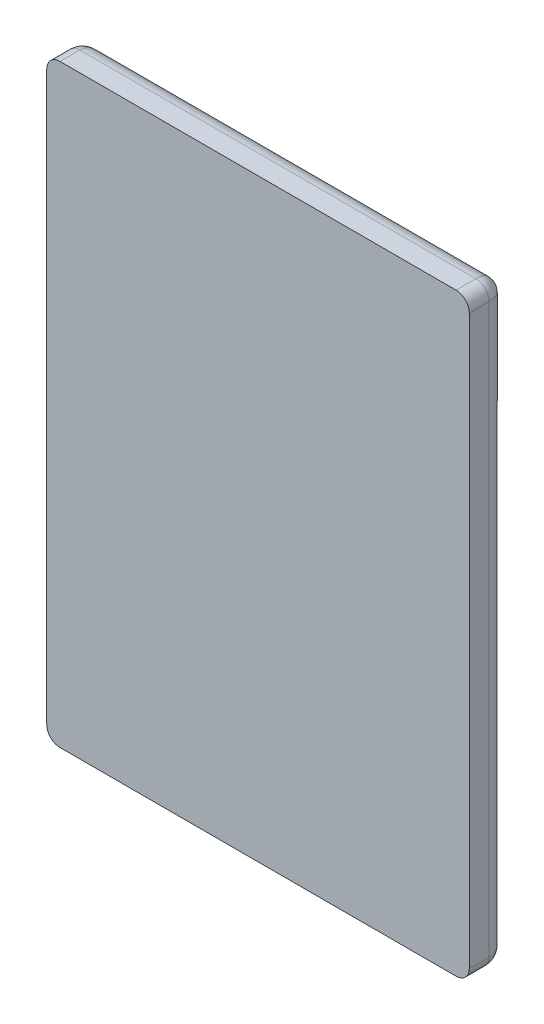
ISO-10303-21;
HEADER;
FILE_DESCRIPTION(('STEP AP214'),'2;1');
FILE_NAME('part.step','',(''),(''),'','','');
FILE_SCHEMA(('AUTOMOTIVE_DESIGN { 1 0 10303 214 1 1 1 1 }'));
ENDSEC;
DATA;
#1=APPLICATION_CONTEXT('core data for automotive mechanical design processes');
#2=APPLICATION_PROTOCOL_DEFINITION('international standard','automotive_design',2000,#1);
#3=PRODUCT_CONTEXT('',#1,'mechanical');
#4=PRODUCT('Part','Part','',(#3));
#5=PRODUCT_RELATED_PRODUCT_CATEGORY('part','',(#4));
#6=PRODUCT_DEFINITION_FORMATION('','',#4);
#7=PRODUCT_DEFINITION_CONTEXT('part definition',#1,'design');
#8=PRODUCT_DEFINITION('design','',#6,#7);
#9=PRODUCT_DEFINITION_SHAPE('','',#8);
#10=(LENGTH_UNIT() NAMED_UNIT(*) SI_UNIT(.MILLI.,.METRE.));
#11=(NAMED_UNIT(*) PLANE_ANGLE_UNIT() SI_UNIT($,.RADIAN.));
#12=(NAMED_UNIT(*) SI_UNIT($,.STERADIAN.) SOLID_ANGLE_UNIT());
#13=UNCERTAINTY_MEASURE_WITH_UNIT(LENGTH_MEASURE(1.E-05),#10,'distance_accuracy_value','');
#14=(GEOMETRIC_REPRESENTATION_CONTEXT(3) GLOBAL_UNCERTAINTY_ASSIGNED_CONTEXT((#13)) GLOBAL_UNIT_ASSIGNED_CONTEXT((#10,
#11,#12)) REPRESENTATION_CONTEXT('',''));
#15=CARTESIAN_POINT('',(0.,0.,0.));
#16=DIRECTION('',(0.,0.,1.));
#17=DIRECTION('',(1.,0.,0.));
#18=AXIS2_PLACEMENT_3D('',#15,#16,#17);
#19=CARTESIAN_POINT('',(8.5,-22.5,1.5));
#20=CARTESIAN_POINT('',(8.64959965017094,-22.5,1.5));
#21=CARTESIAN_POINT('',(8.87382146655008,-22.4486455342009,1.5));
#22=CARTESIAN_POINT('',(9.12870261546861,-22.2883274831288,1.5));
#23=CARTESIAN_POINT('',(9.31506466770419,-22.1021532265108,1.5));
#24=CARTESIAN_POINT('',(9.46187723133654,-21.836565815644,1.5));
#25=CARTESIAN_POINT('',(9.5,-21.6121997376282,1.5));
#26=CARTESIAN_POINT('',(9.5,-21.5,1.5));
#27=CARTESIAN_POINT('',(8.5,-22.5,1.38780026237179));
#28=CARTESIAN_POINT('',(8.64959965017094,-22.5,1.3765841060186));
#29=CARTESIAN_POINT('',(8.87382146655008,-22.4486455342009,1.36367785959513));
#30=CARTESIAN_POINT('',(9.12870261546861,-22.2883274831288,1.35659921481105));
#31=CARTESIAN_POINT('',(9.31506466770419,-22.1021532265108,1.3565890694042));
#32=CARTESIAN_POINT('',(9.46187723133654,-21.836565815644,1.36547389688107));
#33=CARTESIAN_POINT('',(9.5,-21.6121997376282,1.37940644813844));
#34=CARTESIAN_POINT('',(9.5,-21.5,1.38780026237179));
#35=CARTESIAN_POINT('',(8.49366788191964,-22.4810036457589,1.21952047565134));
#36=CARTESIAN_POINT('',(8.63881278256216,-22.477003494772,1.19182179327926));
#37=CARTESIAN_POINT('',(8.85635798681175,-22.4220191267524,1.15996321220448));
#38=CARTESIAN_POINT('',(9.10512871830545,-22.2621179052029,1.14250723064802));
#39=CARTESIAN_POINT('',(9.28839726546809,-22.0790138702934,1.14248074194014));
#40=CARTESIAN_POINT('',(9.4356110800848,-21.8202044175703,1.16439227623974));
#41=CARTESIAN_POINT('',(9.47798110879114,-21.6025209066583,1.19878205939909));
#42=CARTESIAN_POINT('',(9.48100364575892,-21.4936678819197,1.21952047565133));
#43=CARTESIAN_POINT('',(8.46256986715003,-22.3877096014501,0.895587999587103));
#44=CARTESIAN_POINT('',(8.58874628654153,-22.3682228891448,0.846188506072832));
#45=CARTESIAN_POINT('',(8.77793993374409,-22.3005097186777,0.789954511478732));
#46=CARTESIAN_POINT('',(8.99993494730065,-22.1445614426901,0.759259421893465));
#47=CARTESIAN_POINT('',(9.16875222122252,-21.9758598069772,0.759219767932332));
#48=CARTESIAN_POINT('',(9.31524917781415,-21.746468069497,0.797726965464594));
#49=CARTESIAN_POINT('',(9.37313062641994,-21.557213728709,0.858596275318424));
#50=CARTESIAN_POINT('',(9.38770960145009,-21.46256986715,0.895587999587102));
#51=CARTESIAN_POINT('',(8.38926968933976,-22.1678090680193,0.496981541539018));
#52=CARTESIAN_POINT('',(8.47892632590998,-22.1235422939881,0.445956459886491));
#53=CARTESIAN_POINT('',(8.61344255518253,-22.0389579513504,0.389505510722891));
#54=CARTESIAN_POINT('',(8.78105569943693,-21.898063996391,0.359036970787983));
#55=CARTESIAN_POINT('',(8.91759848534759,-21.7615567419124,0.359014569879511));
#56=CARTESIAN_POINT('',(9.05464864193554,-21.5910285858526,0.397176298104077));
#57=CARTESIAN_POINT('',(9.13468095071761,-21.4565326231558,0.458739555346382));
#58=CARTESIAN_POINT('',(9.16780906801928,-21.3892696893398,0.496981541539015));
#59=CARTESIAN_POINT('',(8.22436798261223,-21.6731039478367,0.102446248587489));
#60=CARTESIAN_POINT('',(8.26696463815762,-21.6301813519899,0.088462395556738));
#61=CARTESIAN_POINT('',(8.33089163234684,-21.5659542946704,0.0737411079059));
#62=CARTESIAN_POINT('',(8.41624895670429,-21.4803399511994,0.065956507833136));
#63=CARTESIAN_POINT('',(8.49103661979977,-21.4055651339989,0.065958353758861));
#64=CARTESIAN_POINT('',(8.57667160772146,-21.3202344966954,0.075679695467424));
#65=CARTESIAN_POINT('',(8.64096902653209,-21.256330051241,0.091946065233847));
#66=CARTESIAN_POINT('',(8.67310394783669,-21.2243679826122,0.102446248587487));
#67=CARTESIAN_POINT('',(8.07479982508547,-21.2243994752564,0.));
#68=CARTESIAN_POINT('',(8.08904741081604,-21.2101518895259,0.));
#69=CARTESIAN_POINT('',(8.11041878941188,-21.18878051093,0.));
#70=CARTESIAN_POINT('',(8.13891396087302,-21.1602853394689,0.));
#71=CARTESIAN_POINT('',(8.16384723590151,-21.1353520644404,0.));
#72=CARTESIAN_POINT('',(8.19234240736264,-21.1068568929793,0.));
#73=CARTESIAN_POINT('',(8.21371378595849,-21.0854855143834,0.));
#74=CARTESIAN_POINT('',(8.22439947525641,-21.0747998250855,0.));
#75=CARTESIAN_POINT('',(8.,-21.,0.));
#76=CARTESIAN_POINT('',(8.,-21.,0.));
#77=CARTESIAN_POINT('',(7.99999999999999,-21.,0.));
#78=CARTESIAN_POINT('',(8.,-21.,0.));
#79=CARTESIAN_POINT('',(8.,-21.,0.));
#80=CARTESIAN_POINT('',(8.,-21.,0.));
#81=CARTESIAN_POINT('',(8.,-21.,0.));
#82=CARTESIAN_POINT('',(8.,-21.,0.));
#83=B_SPLINE_SURFACE_WITH_KNOTS('',3,3,((#19,#20,#21,#22,#23,#24,#25,#26),(#27,#28,#29,#30,#31,
#32,#33,#34),(#35,#36,#37,#38,#39,#40,#41,#42),(#43,#44,#45,#46,#47,#48,#49,#50),(#51,#52,#53,
#54,#55,#56,#57,#58),(#59,#60,#61,#62,#63,#64,#65,#66),(#67,#68,#69,#70,#71,#72,#73,#74),(#75,
#76,#77,#78,#79,#80,#81,#82)),.UNSPECIFIED.,.F.,.F.,.F.,(4,1,1,1,1,4),(4,1,1,1,1,4),(0.,
0.224399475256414,0.336599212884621,0.673198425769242,1.12199737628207,1.5707963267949),(0.,
0.285714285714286,0.428571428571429,0.571428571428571,0.785714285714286,1.),.UNSPECIFIED.);
#84=CARTESIAN_POINT('',(8.,-21.,0.));
#85=CARTESIAN_POINT('',(8.22439947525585,-21.074799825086,0.));
#86=CARTESIAN_POINT('',(8.673103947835,-21.2243679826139,0.102446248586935));
#87=CARTESIAN_POINT('',(9.16780906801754,-21.3892696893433,0.496981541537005));
#88=CARTESIAN_POINT('',(9.38770960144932,-21.462569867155,0.895587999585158));
#89=CARTESIAN_POINT('',(9.48100364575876,-21.4936678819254,1.21952047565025));
#90=CARTESIAN_POINT('',(9.5,-21.5000000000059,1.38780026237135));
#91=CARTESIAN_POINT('',(9.5,-21.5000000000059,1.5));
#92=B_SPLINE_CURVE_WITH_KNOTS('',3,(#84,#85,#86,#87,#88,#89,#90,#91),.UNSPECIFIED.,.F.,.F.,(4,1,
1,1,1,4),(0.,0.448798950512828,0.897597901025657,1.23419711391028,1.34639685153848,
1.5707963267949),.UNSPECIFIED.);
#93=CARTESIAN_POINT('',(9.5,-21.5,1.5));
#94=VERTEX_POINT('',#93);
#95=CARTESIAN_POINT('',(7.99999999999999,-21.,0.));
#96=VERTEX_POINT('',#95);
#97=EDGE_CURVE('E112',#94,#96,#92,.F.);
#98=CARTESIAN_POINT('',(9.5,-21.5,1.5));
#99=CARTESIAN_POINT('',(9.50000000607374,-21.5130898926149,1.5));
#100=CARTESIAN_POINT('',(9.49974055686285,-21.5261796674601,1.5));
#101=CARTESIAN_POINT('',(9.4987061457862,-21.5523388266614,1.5));
#102=CARTESIAN_POINT('',(9.49793118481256,-21.5654082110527,1.5));
#103=CARTESIAN_POINT('',(9.4958691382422,-21.5915066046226,1.5));
#104=CARTESIAN_POINT('',(9.49458204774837,-21.6045356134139,1.5));
#105=CARTESIAN_POINT('',(9.491499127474,-21.6305333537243,1.5));
#106=CARTESIAN_POINT('',(9.48970329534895,-21.6435020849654,1.5));
#107=CARTESIAN_POINT('',(9.48560626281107,-21.6693593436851,1.5));
#108=CARTESIAN_POINT('',(9.48330506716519,-21.682247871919,1.5));
#109=CARTESIAN_POINT('',(9.47820068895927,-21.7079248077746,1.5));
#110=CARTESIAN_POINT('',(9.47539751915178,-21.7207132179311,1.5));
#111=CARTESIAN_POINT('',(9.46929251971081,-21.746169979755,1.5));
#112=CARTESIAN_POINT('',(9.46599070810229,-21.7588383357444,1.5));
#113=CARTESIAN_POINT('',(9.45889195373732,-21.7840351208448,1.5));
#114=CARTESIAN_POINT('',(9.45509502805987,-21.7965635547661,1.5));
#115=CARTESIAN_POINT('',(9.44700883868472,-21.8214603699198,1.5));
#116=CARTESIAN_POINT('',(9.44271958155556,-21.8338287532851,1.5));
#117=CARTESIAN_POINT('',(9.43365486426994,-21.8583863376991,1.5));
#118=CARTESIAN_POINT('',(9.4288793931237,-21.8705755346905,1.5));
#119=CARTESIAN_POINT('',(9.41885282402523,-21.8947572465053,1.5));
#120=CARTESIAN_POINT('',(9.41360170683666,-21.9067497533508,1.5));
#121=CARTESIAN_POINT('',(9.40263352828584,-21.9305202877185,1.5));
#122=CARTESIAN_POINT('',(9.39691644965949,-21.942298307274,1.5));
#123=CARTESIAN_POINT('',(9.38502625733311,-21.9656221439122,1.5));
#124=CARTESIAN_POINT('',(9.3788531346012,-21.9771679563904,1.5));
#125=CARTESIAN_POINT('',(9.36606069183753,-22.0000096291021,1.5));
#126=CARTESIAN_POINT('',(9.35944137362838,-22.0113054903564,1.5));
#127=CARTESIAN_POINT('',(9.34576639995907,-22.03362952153,1.5));
#128=CARTESIAN_POINT('',(9.33871075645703,-22.044657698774,1.5));
#129=CARTESIAN_POINT('',(9.32417295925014,-22.0664285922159,1.5));
#130=CARTESIAN_POINT('',(9.31669082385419,-22.0771713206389,1.5));
#131=CARTESIAN_POINT('',(9.30130998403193,-22.0983536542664,1.5));
#132=CARTESIAN_POINT('',(9.29341129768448,-22.1087932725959,1.5));
#133=CARTESIAN_POINT('',(9.27720689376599,-22.1293513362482,1.5));
#134=CARTESIAN_POINT('',(9.26890118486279,-22.139469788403,1.5));
#135=CARTESIAN_POINT('',(9.25189706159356,-22.1593713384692,1.5));
#136=CARTESIAN_POINT('',(9.24319864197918,-22.1691544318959,1.5));
#137=CARTESIAN_POINT('',(9.22542403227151,-22.1883717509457,1.5));
#138=CARTESIAN_POINT('',(9.21634783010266,-22.197805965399,1.5));
#139=CARTESIAN_POINT('',(9.19783240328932,-22.2163118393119,1.5));
#140=CARTESIAN_POINT('',(9.18839316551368,-22.225383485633,1.5));
#141=CARTESIAN_POINT('',(9.16916647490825,-22.2431505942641,1.5));
#142=CARTESIAN_POINT('',(9.15937901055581,-22.2518460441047,1.5));
#143=CARTESIAN_POINT('',(9.13947059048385,-22.268847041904,1.5));
#144=CARTESIAN_POINT('',(9.12934962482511,-22.2771525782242,1.5));
#145=CARTESIAN_POINT('',(9.10878927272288,-22.2933602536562,1.5));
#146=CARTESIAN_POINT('',(9.09834987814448,-22.3012623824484,1.5));
#147=CARTESIAN_POINT('',(9.07716951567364,-22.3166516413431,1.5));
#148=CARTESIAN_POINT('',(9.06642854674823,-22.3241387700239,1.5));
#149=CARTESIAN_POINT('',(9.04466174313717,-22.33868624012,1.5));
#150=CARTESIAN_POINT('',(9.03363591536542,-22.3457465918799,1.5));
#151=CARTESIAN_POINT('',(9.01131612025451,-22.359428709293,1.5));
#152=CARTESIAN_POINT('',(9.00002216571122,-22.366050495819,1.5));
#153=CARTESIAN_POINT('',(8.97718293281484,-22.3788438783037,1.5));
#154=CARTESIAN_POINT('',(8.96563766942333,-22.3850155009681,1.5));
#155=CARTESIAN_POINT('',(8.94231226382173,-22.3968961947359,1.5));
#156=CARTESIAN_POINT('',(8.93053213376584,-22.4026052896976,1.5));
#157=CARTESIAN_POINT('',(8.90675500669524,-22.4135520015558,1.5));
#158=CARTESIAN_POINT('',(8.89475801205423,-22.418789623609,1.5));
#159=CARTESIAN_POINT('',(8.87056705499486,-22.4287892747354,1.5));
#160=CARTESIAN_POINT('',(8.8583730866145,-22.4335512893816,1.5));
#161=CARTESIAN_POINT('',(8.83380760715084,-22.4425947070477,1.5));
#162=CARTESIAN_POINT('',(8.82143608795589,-22.4468760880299,1.5));
#163=CARTESIAN_POINT('',(8.79653504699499,-22.4549534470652,1.5));
#164=CARTESIAN_POINT('',(8.78400551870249,-22.4587494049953,1.5));
#165=CARTESIAN_POINT('',(8.75880796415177,-22.4658510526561,1.5));
#166=CARTESIAN_POINT('',(8.74613993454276,-22.469156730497,1.5));
#167=CARTESIAN_POINT('',(8.7206848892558,-22.4752729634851,1.5));
#168=CARTESIAN_POINT('',(8.7078978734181,-22.4780835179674,1.5));
#169=CARTESIAN_POINT('',(8.68222436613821,-22.4832046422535,1.5));
#170=CARTESIAN_POINT('',(8.66933787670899,-22.4855152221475,1.5));
#171=CARTESIAN_POINT('',(8.64348493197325,-22.4896315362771,1.5));
#172=CARTESIAN_POINT('',(8.6305184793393,-22.4914372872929,1.5));
#173=CARTESIAN_POINT('',(8.60452512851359,-22.4945390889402,1.5));
#174=CARTESIAN_POINT('',(8.5914982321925,-22.4958351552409,1.5));
#175=CARTESIAN_POINT('',(8.56540348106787,-22.4979127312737,1.5));
#176=CARTESIAN_POINT('',(8.55233562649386,-22.4986942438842,1.5));
#177=CARTESIAN_POINT('',(8.52617857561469,-22.4997379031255,1.5));
#178=CARTESIAN_POINT('',(8.51308937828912,-22.5000000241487,1.5));
#179=CARTESIAN_POINT('',(8.5,-22.5,1.5));
#180=B_SPLINE_CURVE_WITH_KNOTS('',3,(#98,#99,#100,#101,#102,#103,#104,#105,#106,#107,#108,#109,
#110,#111,#112,#113,#114,#115,#116,#117,#118,#119,#120,#121,#122,#123,#124,#125,#126,#127,#128,
#129,#130,#131,#132,#133,#134,#135,#136,#137,#138,#139,#140,#141,#142,#143,#144,#145,#146,#147,
#148,#149,#150,#151,#152,#153,#154,#155,#156,#157,#158,#159,#160,#161,#162,#163,#164,#165,#166,
#167,#168,#169,#170,#171,#172,#173,#174,#175,#176,#177,#178,#179),.UNSPECIFIED.,.F.,.F.,(4,2,2,
2,2,2,2,2,2,2,2,2,2,2,2,2,2,2,2,2,2,2,2,2,2,2,2,2,2,2,2,2,2,2,2,2,2,2,2,2,4),(0.,
0.039266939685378,0.0785338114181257,0.117801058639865,0.157068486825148,0.196335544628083,
0.23560160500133,0.274866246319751,0.314129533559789,0.353392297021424,0.392655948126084,
0.431921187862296,0.471187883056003,0.510455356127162,0.549722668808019,0.588988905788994,
0.628253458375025,0.667516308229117,0.706778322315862,0.746040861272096,0.785304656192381,
0.824569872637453,0.863836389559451,0.903104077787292,0.94237277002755,0.981641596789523,
1.02090947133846,1.06017547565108,1.09943914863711,1.13870079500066,1.17796201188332,
1.2172244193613,1.25648862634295,1.29575446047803,1.33502124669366,1.37428808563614,
1.41355413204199,1.45281887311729,1.49208240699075,1.53134572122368,1.5706109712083),.UNSPECIFIED.);
#181=CARTESIAN_POINT('',(8.5,-22.5,1.5));
#182=VERTEX_POINT('',#181);
#183=EDGE_CURVE('E95',#94,#182,#180,.T.);
#184=CARTESIAN_POINT('',(8.5,-22.5,1.5));
#185=CARTESIAN_POINT('',(8.50000003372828,-22.5000001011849,1.48036469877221));
#186=CARTESIAN_POINT('',(8.49987071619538,-22.4996121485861,1.46072956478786));
#187=CARTESIAN_POINT('',(8.49935489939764,-22.4980646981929,1.4214900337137));
#188=CARTESIAN_POINT('',(8.4989683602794,-22.4969050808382,1.40188564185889));
#189=CARTESIAN_POINT('',(8.49793945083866,-22.493818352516,1.36273758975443));
#190=CARTESIAN_POINT('',(8.49729699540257,-22.4918909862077,1.34319395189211));
#191=CARTESIAN_POINT('',(8.49575764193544,-22.4872729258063,1.30419727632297));
#192=CARTESIAN_POINT('',(8.49486061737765,-22.484581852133,1.2847442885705));
#193=CARTESIAN_POINT('',(8.49281352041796,-22.4784405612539,1.24595878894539));
#194=CARTESIAN_POINT('',(8.49166328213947,-22.4749898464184,1.22662636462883));
#195=CARTESIAN_POINT('',(8.48911106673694,-22.4673332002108,1.18811190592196));
#196=CARTESIAN_POINT('',(8.4877088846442,-22.4631266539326,1.16893000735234));
#197=CARTESIAN_POINT('',(8.48465444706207,-22.4539633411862,1.13074633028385));
#198=CARTESIAN_POINT('',(8.48300194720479,-22.4490058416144,1.11174474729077));
#199=CARTESIAN_POINT('',(8.47944958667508,-22.4383487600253,1.07395057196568));
#200=CARTESIAN_POINT('',(8.47754944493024,-22.4326483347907,1.05515824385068));
#201=CARTESIAN_POINT('',(8.47350412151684,-22.4205123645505,1.01781181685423));
#202=CARTESIAN_POINT('',(8.47135862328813,-22.4140758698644,0.999258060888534));
#203=CARTESIAN_POINT('',(8.46682603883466,-22.400478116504,0.962417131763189));
#204=CARTESIAN_POINT('',(8.46443860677,-22.39331582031,0.944130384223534));
#205=CARTESIAN_POINT('',(8.45942703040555,-22.3782810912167,0.907850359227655));
#206=CARTESIAN_POINT('',(8.45680252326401,-22.370407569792,0.889857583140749));
#207=CARTESIAN_POINT('',(8.45132138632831,-22.3539641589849,0.854192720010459));
#208=CARTESIAN_POINT('',(8.44846438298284,-22.3453931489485,0.836521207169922));
#209=CARTESIAN_POINT('',(8.44252291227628,-22.3275687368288,0.801526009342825));
#210=CARTESIAN_POINT('',(8.43943806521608,-22.3183141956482,0.784202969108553));
#211=CARTESIAN_POINT('',(8.43304554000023,-22.2991366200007,0.749931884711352));
#212=CARTESIAN_POINT('',(8.42973747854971,-22.2892124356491,0.732984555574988));
#213=CARTESIAN_POINT('',(8.42290316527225,-22.2687094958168,0.699492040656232));
#214=CARTESIAN_POINT('',(8.41937652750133,-22.258129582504,0.682947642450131));
#215=CARTESIAN_POINT('',(8.41210968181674,-22.2363290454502,0.650288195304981));
#216=CARTESIAN_POINT('',(8.40836908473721,-22.2251072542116,0.63417401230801));
#217=CARTESIAN_POINT('',(8.40067900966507,-22.2020370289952,0.602401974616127));
#218=CARTESIAN_POINT('',(8.39672913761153,-22.1901874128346,0.586745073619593));
#219=CARTESIAN_POINT('',(8.38862496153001,-22.16587488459,0.555915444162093));
#220=CARTESIAN_POINT('',(8.38447025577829,-22.1534107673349,0.540743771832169));
#221=CARTESIAN_POINT('',(8.37596400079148,-22.1278920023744,0.510904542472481));
#222=CARTESIAN_POINT('',(8.37161205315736,-22.1148361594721,0.496238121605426));
#223=CARTESIAN_POINT('',(8.36271930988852,-22.0881579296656,0.467428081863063));
#224=CARTESIAN_POINT('',(8.35817812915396,-22.0745343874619,0.453285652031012));
#225=CARTESIAN_POINT('',(8.34891479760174,-22.0467443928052,0.425542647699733));
#226=CARTESIAN_POINT('',(8.34419228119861,-22.0325768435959,0.41194329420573));
#227=CARTESIAN_POINT('',(8.3345741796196,-22.0037225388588,0.385305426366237));
#228=CARTESIAN_POINT('',(8.32967825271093,-21.9890347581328,0.372268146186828));
#229=CARTESIAN_POINT('',(8.31972121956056,-21.9591636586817,0.346773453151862));
#230=CARTESIAN_POINT('',(8.31465979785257,-21.9439793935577,0.334317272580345));
#231=CARTESIAN_POINT('',(8.30437966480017,-21.9131389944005,0.310003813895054));
#232=CARTESIAN_POINT('',(8.29916066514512,-21.8974819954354,0.298147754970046));
#233=CARTESIAN_POINT('',(8.2885732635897,-21.8657197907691,0.275053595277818));
#234=CARTESIAN_POINT('',(8.28320460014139,-21.8496138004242,0.263816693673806));
#235=CARTESIAN_POINT('',(8.27232576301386,-21.8169772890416,0.241979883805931));
#236=CARTESIAN_POINT('',(8.2668153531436,-21.8004460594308,0.231381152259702));
#237=CARTESIAN_POINT('',(8.25566090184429,-21.7669827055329,0.210839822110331));
#238=CARTESIAN_POINT('',(8.25001664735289,-21.7500499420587,0.200898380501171));
#239=CARTESIAN_POINT('',(8.23860244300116,-21.7158073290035,0.181690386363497));
#240=CARTESIAN_POINT('',(8.23283230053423,-21.6984969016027,0.172424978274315));
#241=CARTESIAN_POINT('',(8.22117405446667,-21.6635221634,0.154589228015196));
#242=CARTESIAN_POINT('',(8.21528577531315,-21.6458573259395,0.146020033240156));
#243=CARTESIAN_POINT('',(8.20340005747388,-21.6102001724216,0.12959076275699));
#244=CARTESIAN_POINT('',(8.19740246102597,-21.5922073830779,0.121731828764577));
#245=CARTESIAN_POINT('',(8.18530818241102,-21.5559245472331,0.106728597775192));
#246=CARTESIAN_POINT('',(8.1792113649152,-21.5376340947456,0.0995853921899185));
#247=CARTESIAN_POINT('',(8.16692846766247,-21.5007854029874,0.0860208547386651));
#248=CARTESIAN_POINT('',(8.16074227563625,-21.4822268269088,0.0796005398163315));
#249=CARTESIAN_POINT('',(8.14829052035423,-21.4448715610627,0.0674885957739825));
#250=CARTESIAN_POINT('',(8.14202486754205,-21.4260746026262,0.0617978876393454));
#251=CARTESIAN_POINT('',(8.12942406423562,-21.3882721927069,0.0511521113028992));
#252=CARTESIAN_POINT('',(8.12308884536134,-21.369266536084,0.0461978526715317));
#253=CARTESIAN_POINT('',(8.11035879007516,-21.3310763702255,0.0370319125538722));
#254=CARTESIAN_POINT('',(8.10396390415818,-21.3118917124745,0.0328209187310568));
#255=CARTESIAN_POINT('',(8.09112439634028,-21.2733731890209,0.0251484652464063));
#256=CARTESIAN_POINT('',(8.08467974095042,-21.2540392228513,0.0216875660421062));
#257=CARTESIAN_POINT('',(8.07175057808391,-21.2152517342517,0.0155222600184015));
#258=CARTESIAN_POINT('',(8.06526604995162,-21.1957981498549,0.0128182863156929));
#259=CARTESIAN_POINT('',(8.05226703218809,-21.1568010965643,0.00817379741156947));
#260=CARTESIAN_POINT('',(8.04575253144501,-21.137257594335,0.00623359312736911));
#261=CARTESIAN_POINT('',(8.0327034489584,-21.0981103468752,0.00312357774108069));
#262=CARTESIAN_POINT('',(8.02616886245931,-21.078506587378,0.00195396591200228));
#263=CARTESIAN_POINT('',(8.01308954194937,-21.0392686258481,0.000392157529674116));
#264=CARTESIAN_POINT('',(8.00654480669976,-21.0196344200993,6.48301377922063E-08));
#265=CARTESIAN_POINT('',(8.,-21.,0.));
#266=B_SPLINE_CURVE_WITH_KNOTS('',3,(#184,#185,#186,#187,#188,#189,#190,#191,#192,#193,#194,
#195,#196,#197,#198,#199,#200,#201,#202,#203,#204,#205,#206,#207,#208,#209,#210,#211,#212,#213,
#214,#215,#216,#217,#218,#219,#220,#221,#222,#223,#224,#225,#226,#227,#228,#229,#230,#231,#232,
#233,#234,#235,#236,#237,#238,#239,#240,#241,#242,#243,#244,#245,#246,#247,#248,#249,#250,#251,
#252,#253,#254,#255,#256,#257,#258,#259,#260,#261,#262,#263,#264,#265),.UNSPECIFIED.,.F.,.F.,(4,
2,2,2,2,2,2,2,2,2,2,2,2,2,2,2,2,2,2,2,2,2,2,2,2,2,2,2,2,2,2,2,2,2,2,2,2,2,2,2,4),(0.,
0.0589014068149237,0.117811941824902,0.176742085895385,0.235701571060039,0.294699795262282,
0.353746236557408,0.412850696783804,0.472022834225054,0.53127219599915,0.590607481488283,
0.650035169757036,0.709560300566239,0.769186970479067,0.828918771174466,0.888759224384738,
0.948712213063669,1.00878240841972,1.06897550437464,1.12929613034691,1.1897461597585,
1.25032521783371,1.31103114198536,1.37186043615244,1.43280871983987,1.49387117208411,
1.55504297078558,1.61631972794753,1.67769792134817,1.73917529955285,1.80074980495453,
1.86241682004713,1.92416953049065,1.9859994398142,2.04789682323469,2.10985117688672,
2.1718516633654,2.23388755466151,2.29594867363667,2.35802583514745,2.42011128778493),.UNSPECIFIED.);
#267=EDGE_CURVE('E116',#96,#182,#266,.F.);
#268=ORIENTED_EDGE('',*,*,#97,.F.);
#269=ORIENTED_EDGE('',*,*,#183,.T.);
#270=ORIENTED_EDGE('',*,*,#267,.F.);
#271=EDGE_LOOP('',(#268,#269,#270));
#272=FACE_BOUND('',#271,.T.);
#273=ADVANCED_FACE('F15',(#272),#83,.T.);
#274=CARTESIAN_POINT('',(9.5,21.5,1.5));
#275=CARTESIAN_POINT('',(9.5,21.6495996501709,1.5));
#276=CARTESIAN_POINT('',(9.4486455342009,21.8738214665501,1.5));
#277=CARTESIAN_POINT('',(9.28832748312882,22.1287026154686,1.5));
#278=CARTESIAN_POINT('',(9.10215322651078,22.3150646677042,1.5));
#279=CARTESIAN_POINT('',(8.83656581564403,22.4618772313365,1.5));
#280=CARTESIAN_POINT('',(8.61219973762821,22.5,1.5));
#281=CARTESIAN_POINT('',(8.5,22.5,1.5));
#282=CARTESIAN_POINT('',(9.5,21.5,1.38780026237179));
#283=CARTESIAN_POINT('',(9.5,21.6495996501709,1.3765841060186));
#284=CARTESIAN_POINT('',(9.4486455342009,21.8738214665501,1.36367785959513));
#285=CARTESIAN_POINT('',(9.28832748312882,22.1287026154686,1.35659921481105));
#286=CARTESIAN_POINT('',(9.10215322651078,22.3150646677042,1.3565890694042));
#287=CARTESIAN_POINT('',(8.83656581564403,22.4618772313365,1.36547389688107));
#288=CARTESIAN_POINT('',(8.61219973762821,22.5,1.37940644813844));
#289=CARTESIAN_POINT('',(8.5,22.5,1.38780026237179));
#290=CARTESIAN_POINT('',(9.47476072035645,21.4915869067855,1.163380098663));
#291=CARTESIAN_POINT('',(9.46929669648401,21.6351581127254,1.12990891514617));
#292=CARTESIAN_POINT('',(9.4129652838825,21.8503523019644,1.09140918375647));
#293=CARTESIAN_POINT('',(9.25311469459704,22.0970070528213,1.07031256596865));
#294=CARTESIAN_POINT('',(9.07103700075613,22.2792434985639,1.07028071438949));
#295=CARTESIAN_POINT('',(8.8145859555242,22.4266996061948,1.09676198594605));
#296=CARTESIAN_POINT('',(8.59926085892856,22.4706437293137,1.13832083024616));
#297=CARTESIAN_POINT('',(8.49158690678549,22.4747607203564,1.163380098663));
#298=CARTESIAN_POINT('',(9.36281472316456,21.4542715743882,0.84374801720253));
#299=CARTESIAN_POINT('',(9.33967416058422,21.5757474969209,0.793183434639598));
#300=CARTESIAN_POINT('',(9.2691248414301,21.7579074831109,0.735831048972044));
#301=CARTESIAN_POINT('',(9.1145041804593,21.9731253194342,0.704568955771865));
#302=CARTESIAN_POINT('',(8.94958719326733,22.1381455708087,0.704530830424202));
#303=CARTESIAN_POINT('',(8.72759901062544,22.2840909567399,0.743741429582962));
#304=CARTESIAN_POINT('',(8.54539176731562,22.3455013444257,0.805880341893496));
#305=CARTESIAN_POINT('',(8.45427157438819,22.3628147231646,0.843748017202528));
#306=CARTESIAN_POINT('',(9.12276814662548,21.3742560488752,0.461132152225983));
#307=CARTESIAN_POINT('',(9.07868564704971,21.4596938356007,0.413727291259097));
#308=CARTESIAN_POINT('',(8.99606753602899,21.5878836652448,0.361368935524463));
#309=CARTESIAN_POINT('',(8.86026237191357,21.7480706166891,0.333128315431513));
#310=CARTESIAN_POINT('',(8.72937415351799,21.8789945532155,0.333108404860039));
#311=CARTESIAN_POINT('',(8.56652382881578,22.0112894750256,0.368476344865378));
#312=CARTESIAN_POINT('',(8.43835563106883,22.0897821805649,0.425600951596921));
#313=CARTESIAN_POINT('',(8.37425604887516,22.1227681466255,0.461132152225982));
#314=CARTESIAN_POINT('',(8.67314741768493,21.2243824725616,0.102440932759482));
#315=CARTESIAN_POINT('',(8.63018395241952,21.2669351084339,0.088227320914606));
#316=CARTESIAN_POINT('',(8.56588323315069,21.3307975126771,0.073227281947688));
#317=CARTESIAN_POINT('',(8.48021816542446,21.4161207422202,0.06528685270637));
#318=CARTESIAN_POINT('',(8.40543559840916,21.4909156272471,0.065288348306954));
#319=CARTESIAN_POINT('',(8.32015056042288,21.5766129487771,0.075205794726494));
#320=CARTESIAN_POINT('',(8.25631179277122,21.6409824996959,0.091769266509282));
#321=CARTESIAN_POINT('',(8.22438247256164,21.6731474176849,0.102440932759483));
#322=CARTESIAN_POINT('',(8.22439947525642,21.0747998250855,0.));
#323=CARTESIAN_POINT('',(8.21015188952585,21.089047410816,0.));
#324=CARTESIAN_POINT('',(8.18878051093,21.1104187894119,0.));
#325=CARTESIAN_POINT('',(8.16028533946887,21.138913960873,0.));
#326=CARTESIAN_POINT('',(8.13535206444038,21.1638472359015,0.));
#327=CARTESIAN_POINT('',(8.10685689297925,21.1923424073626,0.));
#328=CARTESIAN_POINT('',(8.0854855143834,21.2137137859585,0.));
#329=CARTESIAN_POINT('',(8.07479982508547,21.2243994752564,0.));
#330=CARTESIAN_POINT('',(8.,21.,0.));
#331=CARTESIAN_POINT('',(8.,21.,0.));
#332=CARTESIAN_POINT('',(8.,21.,0.));
#333=CARTESIAN_POINT('',(8.,21.,0.));
#334=CARTESIAN_POINT('',(8.,21.,0.));
#335=CARTESIAN_POINT('',(8.,21.,0.));
#336=CARTESIAN_POINT('',(8.,21.,0.));
#337=CARTESIAN_POINT('',(8.,21.,0.));
#338=B_SPLINE_SURFACE_WITH_KNOTS('',3,3,((#274,#275,#276,#277,#278,#279,#280,#281),(#282,#283,
#284,#285,#286,#287,#288,#289),(#290,#291,#292,#293,#294,#295,#296,#297),(#298,#299,#300,#301,
#302,#303,#304,#305),(#306,#307,#308,#309,#310,#311,#312,#313),(#314,#315,#316,#317,#318,#319,
#320,#321),(#322,#323,#324,#325,#326,#327,#328,#329),(#330,#331,#332,#333,#334,#335,#336,#337)),
.UNSPECIFIED.,.F.,.F.,.F.,(4,1,1,1,1,4),(4,1,1,1,1,4),(0.,0.224399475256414,0.448798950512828,
0.673198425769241,1.12199737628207,1.5707963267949),(0.,0.285714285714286,0.428571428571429,
0.571428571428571,0.785714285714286,1.),.UNSPECIFIED.);
#339=CARTESIAN_POINT('',(8.,21.,0.));
#340=CARTESIAN_POINT('',(8.07479982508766,21.2243994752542,0.));
#341=CARTESIAN_POINT('',(8.22438247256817,21.6731474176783,0.1024409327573));
#342=CARTESIAN_POINT('',(8.37425604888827,22.1227681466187,0.461132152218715));
#343=CARTESIAN_POINT('',(8.45427157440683,22.362814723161,0.843748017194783));
#344=CARTESIAN_POINT('',(8.49158690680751,22.4747607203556,1.16338009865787));
#345=CARTESIAN_POINT('',(8.50000000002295,22.5,1.38780026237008));
#346=CARTESIAN_POINT('',(8.50000000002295,22.5,1.5));
#347=B_SPLINE_CURVE_WITH_KNOTS('',3,(#339,#340,#341,#342,#343,#344,#345,#346),.UNSPECIFIED.,.F.,
.F.,(4,1,1,1,1,4),(0.,0.448798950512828,0.897597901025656,1.12199737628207,1.34639685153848,
1.5707963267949),.UNSPECIFIED.);
#348=CARTESIAN_POINT('',(8.50000000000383,22.5,1.5));
#349=VERTEX_POINT('',#348);
#350=CARTESIAN_POINT('',(8.,21.,0.));
#351=VERTEX_POINT('',#350);
#352=EDGE_CURVE('E231',#349,#351,#347,.F.);
#353=CARTESIAN_POINT('',(8.5,22.5,1.5));
#354=CARTESIAN_POINT('',(8.61219973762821,22.5,1.5));
#355=CARTESIAN_POINT('',(8.83656581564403,22.4618772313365,1.5));
#356=CARTESIAN_POINT('',(9.10215322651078,22.3150646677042,1.5));
#357=CARTESIAN_POINT('',(9.28832748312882,22.1287026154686,1.5));
#358=CARTESIAN_POINT('',(9.4486455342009,21.8738214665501,1.5));
#359=CARTESIAN_POINT('',(9.5,21.6495996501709,1.5));
#360=CARTESIAN_POINT('',(9.5,21.5,1.5));
#361=B_SPLINE_CURVE_WITH_KNOTS('',3,(#353,#354,#355,#356,#357,#358,#359,#360),.UNSPECIFIED.,.F.,
.F.,(4,1,1,1,1,4),(0.,0.214285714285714,0.428571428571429,0.571428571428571,0.714285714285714,
1.),.UNSPECIFIED.);
#362=CARTESIAN_POINT('',(9.5,21.5,1.5));
#363=VERTEX_POINT('',#362);
#364=EDGE_CURVE('E108',#349,#363,#361,.T.);
#365=CARTESIAN_POINT('',(9.5,21.5,1.5));
#366=CARTESIAN_POINT('',(9.50000008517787,21.5000000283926,1.48036412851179));
#367=CARTESIAN_POINT('',(9.49961349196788,21.4998711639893,1.46072837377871));
#368=CARTESIAN_POINT('',(9.49807041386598,21.499356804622,1.42148669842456));
#369=CARTESIAN_POINT('',(9.49691378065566,21.4989712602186,1.40188078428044));
#370=CARTESIAN_POINT('',(9.49383356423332,21.4979445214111,1.36272929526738));
#371=CARTESIAN_POINT('',(9.49190971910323,21.4973032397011,1.34318374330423));
#372=CARTESIAN_POINT('',(9.48729809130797,21.495766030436,1.30418340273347));
#373=CARTESIAN_POINT('',(9.48460993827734,21.4948699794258,1.28472866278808));
#374=CARTESIAN_POINT('',(9.47847283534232,21.4928242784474,1.24594034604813));
#375=CARTESIAN_POINT('',(9.47502340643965,21.4916744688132,1.22660685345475));
#376=CARTESIAN_POINT('',(9.4673662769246,21.4891220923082,1.18809155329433));
#377=CARTESIAN_POINT('',(9.46315798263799,21.487719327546,1.1689098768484));
#378=CARTESIAN_POINT('',(9.45398815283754,21.4846627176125,1.13072809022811));
#379=CARTESIAN_POINT('',(9.44902589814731,21.4830086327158,1.11172817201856));
#380=CARTESIAN_POINT('',(9.43835981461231,21.4794532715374,1.0739376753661));
#381=CARTESIAN_POINT('',(9.43265515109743,21.4775517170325,1.05514735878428));
#382=CARTESIAN_POINT('',(9.42051485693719,21.4735049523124,1.0178040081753));
#383=CARTESIAN_POINT('',(9.41407829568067,21.4713594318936,0.999251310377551));
#384=CARTESIAN_POINT('',(9.40048503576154,21.4668283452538,0.962411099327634));
#385=CARTESIAN_POINT('',(9.39332732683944,21.4644424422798,0.944124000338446));
#386=CARTESIAN_POINT('',(9.37830263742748,21.4594342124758,0.907842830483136));
#387=CARTESIAN_POINT('',(9.37043457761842,21.4568115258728,0.889849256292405));
#388=CARTESIAN_POINT('',(9.35399960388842,21.4513332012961,0.854183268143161));
#389=CARTESIAN_POINT('',(9.3454315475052,21.4484771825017,0.836511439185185));
#390=CARTESIAN_POINT('',(9.32760973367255,21.4425365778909,0.80151633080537));
#391=CARTESIAN_POINT('',(9.31835479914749,21.4394515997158,0.784193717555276));
#392=CARTESIAN_POINT('',(9.29917430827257,21.4330581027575,0.749923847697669));
#393=CARTESIAN_POINT('',(9.2892475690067,21.4297491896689,0.732977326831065));
#394=CARTESIAN_POINT('',(9.26873814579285,21.4229127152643,0.699486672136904));
#395=CARTESIAN_POINT('',(9.25815427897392,21.419384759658,0.682943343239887));
#396=CARTESIAN_POINT('',(9.23634533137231,21.4121151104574,0.650286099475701));
#397=CARTESIAN_POINT('',(9.22511906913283,21.4083730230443,0.634173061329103));
#398=CARTESIAN_POINT('',(9.20204022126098,21.4006800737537,0.602403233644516));
#399=CARTESIAN_POINT('',(9.19018645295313,21.396728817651,0.586747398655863));
#400=CARTESIAN_POINT('',(9.16586678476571,21.3886222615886,0.55591957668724));
#401=CARTESIAN_POINT('',(9.15339969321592,21.3844665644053,0.540748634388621));
#402=CARTESIAN_POINT('',(9.12787612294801,21.3759587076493,0.510910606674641));
#403=CARTESIAN_POINT('',(9.11481846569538,21.3716061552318,0.49624464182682));
#404=CARTESIAN_POINT('',(9.08813757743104,21.3627125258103,0.46743530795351));
#405=CARTESIAN_POINT('',(9.07451320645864,21.3581710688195,0.45329311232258));
#406=CARTESIAN_POINT('',(9.04672237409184,21.3489074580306,0.425550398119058));
#407=CARTESIAN_POINT('',(9.03255482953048,21.3441849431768,0.411951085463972));
#408=CARTESIAN_POINT('',(9.00370119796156,21.3345670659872,0.385313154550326));
#409=CARTESIAN_POINT('',(8.98901409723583,21.3296713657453,0.372275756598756));
#410=CARTESIAN_POINT('',(8.95914486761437,21.3197149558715,0.346780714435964));
#411=CARTESIAN_POINT('',(8.94396180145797,21.3146539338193,0.334324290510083));
#412=CARTESIAN_POINT('',(8.91312415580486,21.3043747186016,0.310010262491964));
#413=CARTESIAN_POINT('',(8.89746871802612,21.299156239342,0.29815386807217));
#414=CARTESIAN_POINT('',(8.86570983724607,21.2885699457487,0.275058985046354));
#415=CARTESIAN_POINT('',(8.84960561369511,21.2832018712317,0.263821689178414));
#416=CARTESIAN_POINT('',(8.81697268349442,21.2723242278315,0.241984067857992));
#417=CARTESIAN_POINT('',(8.80044326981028,21.2668144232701,0.231384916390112));
#418=CARTESIAN_POINT('',(8.76698344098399,21.2556611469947,0.210842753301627));
#419=CARTESIAN_POINT('',(8.75005238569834,21.2500174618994,0.200900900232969));
#420=CARTESIAN_POINT('',(8.71581292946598,21.238604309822,0.181692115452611));
#421=CARTESIAN_POINT('',(8.69850394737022,21.2328346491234,0.172426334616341));
#422=CARTESIAN_POINT('',(8.66353168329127,21.2211772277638,0.154589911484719));
#423=CARTESIAN_POINT('',(8.64586786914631,21.2152892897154,0.146020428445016));
#424=CARTESIAN_POINT('',(8.61021229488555,21.2034040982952,0.129590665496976));
#425=CARTESIAN_POINT('',(8.59222005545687,21.1974066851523,0.121731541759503));
#426=CARTESIAN_POINT('',(8.55593792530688,21.185312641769,0.106727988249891));
#427=CARTESIAN_POINT('',(8.53764762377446,21.1792158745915,0.0995846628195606));
#428=CARTESIAN_POINT('',(8.50079891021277,21.1669329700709,0.0860199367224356));
#429=CARTESIAN_POINT('',(8.48224015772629,21.1607467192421,0.0795995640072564));
#430=CARTESIAN_POINT('',(8.44488428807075,21.1482947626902,0.0674875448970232));
#431=CARTESIAN_POINT('',(8.42608689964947,21.1420289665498,0.0617968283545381));
#432=CARTESIAN_POINT('',(8.38828345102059,21.1294278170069,0.051151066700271));
#433=CARTESIAN_POINT('',(8.36927718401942,21.1230923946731,0.0461968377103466));
#434=CARTESIAN_POINT('',(8.33108569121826,21.1103618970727,0.037030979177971));
#435=CARTESIAN_POINT('',(8.31190031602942,21.1039667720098,0.032820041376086));
#436=CARTESIAN_POINT('',(8.27338032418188,21.0911267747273,0.0251477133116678));
#437=CARTESIAN_POINT('',(8.2540456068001,21.0846818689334,0.0216868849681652));
#438=CARTESIAN_POINT('',(8.21525665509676,21.0717522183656,0.0155217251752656));
#439=CARTESIAN_POINT('',(8.19580235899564,21.0652674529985,0.012817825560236));
#440=CARTESIAN_POINT('',(8.15680399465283,21.0522679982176,0.00817348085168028));
#441=CARTESIAN_POINT('',(8.13725989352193,21.0457532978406,0.00623334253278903));
#442=CARTESIAN_POINT('',(8.09811163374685,21.0327038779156,0.00312344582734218));
#443=CARTESIAN_POINT('',(8.07850746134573,21.0261691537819,0.00195387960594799));
#444=CARTESIAN_POINT('',(8.03926893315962,21.0130896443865,0.000392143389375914));
#445=CARTESIAN_POINT('',(8.01963457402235,21.0065448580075,6.70825923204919E-08));
#446=CARTESIAN_POINT('',(8.,21.,0.));
#447=B_SPLINE_CURVE_WITH_KNOTS('',3,(#365,#366,#367,#368,#369,#370,#371,#372,#373,#374,#375,
#376,#377,#378,#379,#380,#381,#382,#383,#384,#385,#386,#387,#388,#389,#390,#391,#392,#393,#394,
#395,#396,#397,#398,#399,#400,#401,#402,#403,#404,#405,#406,#407,#408,#409,#410,#411,#412,#413,
#414,#415,#416,#417,#418,#419,#420,#421,#422,#423,#424,#425,#426,#427,#428,#429,#430,#431,#432,
#433,#434,#435,#436,#437,#438,#439,#440,#441,#442,#443,#444,#445,#446),.UNSPECIFIED.,.F.,.F.,(4,
2,2,2,2,2,2,2,2,2,2,2,2,2,2,2,2,2,2,2,2,2,2,2,2,2,2,2,2,2,2,2,2,2,2,2,2,2,2,2,4),(0.,
0.0589032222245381,0.117817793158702,0.176752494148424,0.235715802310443,0.294716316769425,
0.353763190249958,0.412866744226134,0.472037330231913,0.531284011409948,0.590614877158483,
0.650037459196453,0.70955904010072,0.76918508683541,0.828919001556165,0.888763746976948,
0.948722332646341,1.00879825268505,1.06899590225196,1.12931949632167,1.18977093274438,
1.25034992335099,1.3110544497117,1.37188121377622,1.43282608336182,1.49388453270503,
1.55505207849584,1.61632471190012,1.67769932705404,1.73917411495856,1.80074722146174,
1.86241390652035,1.92416719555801,1.98599841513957,2.04789764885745,2.10985418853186,
2.17185698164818,2.23389507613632,2.29595806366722,2.35803652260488,2.42012246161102),.UNSPECIFIED.);
#448=EDGE_CURVE('E123',#351,#363,#447,.F.);
#449=ORIENTED_EDGE('',*,*,#352,.F.);
#450=ORIENTED_EDGE('',*,*,#364,.T.);
#451=ORIENTED_EDGE('',*,*,#448,.F.);
#452=EDGE_LOOP('',(#449,#450,#451));
#453=FACE_BOUND('',#452,.T.);
#454=ADVANCED_FACE('F331',(#453),#338,.T.);
#455=CARTESIAN_POINT('',(-21.5,22.5,1.5));
#456=CARTESIAN_POINT('',(-21.6495996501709,22.5,1.5));
#457=CARTESIAN_POINT('',(-21.8738200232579,22.4486419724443,1.5));
#458=CARTESIAN_POINT('',(-22.1287012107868,22.2883243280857,1.5));
#459=CARTESIAN_POINT('',(-22.3150634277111,22.1021506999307,1.5));
#460=CARTESIAN_POINT('',(-22.461876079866,21.8365639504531,1.5));
#461=CARTESIAN_POINT('',(-22.5,21.6121997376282,1.5));
#462=CARTESIAN_POINT('',(-22.5,21.5,1.5));
#463=CARTESIAN_POINT('',(-21.5,22.5,1.38780026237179));
#464=CARTESIAN_POINT('',(-21.6495996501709,22.5,1.3765841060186));
#465=CARTESIAN_POINT('',(-21.8738200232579,22.4486419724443,1.36367785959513));
#466=CARTESIAN_POINT('',(-22.1287012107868,22.2883243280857,1.35659921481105));
#467=CARTESIAN_POINT('',(-22.3150634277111,22.1021506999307,1.3565890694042));
#468=CARTESIAN_POINT('',(-22.461876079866,21.8365639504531,1.36547389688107));
#469=CARTESIAN_POINT('',(-22.5,21.6121997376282,1.37940644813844));
#470=CARTESIAN_POINT('',(-22.5,21.5,1.38780026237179));
#471=CARTESIAN_POINT('',(-21.4936678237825,22.4810034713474,1.21952263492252));
#472=CARTESIAN_POINT('',(-21.6388114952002,22.4769995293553,1.19182072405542));
#473=CARTESIAN_POINT('',(-21.8563548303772,22.4220136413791,1.15996565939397));
#474=CARTESIAN_POINT('',(-22.105124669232,22.2621117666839,1.14250951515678));
#475=CARTESIAN_POINT('',(-22.2883930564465,22.0790090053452,1.14248346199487));
#476=CARTESIAN_POINT('',(-22.4356076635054,21.8202009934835,1.16439442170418));
#477=CARTESIAN_POINT('',(-22.4779798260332,21.602520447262,1.19878388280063));
#478=CARTESIAN_POINT('',(-22.4810034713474,21.4936678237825,1.21952263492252));
#479=CARTESIAN_POINT('',(-21.4625698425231,22.3877095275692,0.895590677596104));
#480=CARTESIAN_POINT('',(-21.5887446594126,22.3682176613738,0.846187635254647));
#481=CARTESIAN_POINT('',(-21.7779362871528,22.3005035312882,0.789958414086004));
#482=CARTESIAN_POINT('',(-21.9999301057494,22.1445543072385,0.75926346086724));
#483=CARTESIAN_POINT('',(-22.1687470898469,21.9758542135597,0.759224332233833));
#484=CARTESIAN_POINT('',(-22.3152450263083,21.7464641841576,0.797730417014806));
#485=CARTESIAN_POINT('',(-22.3731290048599,21.5572131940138,0.858598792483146));
#486=CARTESIAN_POINT('',(-22.3877095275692,21.4625698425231,0.895590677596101));
#487=CARTESIAN_POINT('',(-21.3892696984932,22.1678090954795,0.496985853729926));
#488=CARTESIAN_POINT('',(-21.4789238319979,22.1235341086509,0.445954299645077));
#489=CARTESIAN_POINT('',(-21.6134381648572,22.0389518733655,0.389505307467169));
#490=CARTESIAN_POINT('',(-21.7810497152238,21.8980557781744,0.359035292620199));
#491=CARTESIAN_POINT('',(-21.9175921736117,21.7615503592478,0.359013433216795));
#492=CARTESIAN_POINT('',(-22.0546440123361,21.5910240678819,0.397176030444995));
#493=CARTESIAN_POINT('',(-22.1346789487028,21.4565319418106,0.458741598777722));
#494=CARTESIAN_POINT('',(-22.1678090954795,21.3892696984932,0.496985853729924));
#495=CARTESIAN_POINT('',(-21.2243681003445,21.6731043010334,0.102454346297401));
#496=CARTESIAN_POINT('',(-21.2669615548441,21.6301718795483,0.088463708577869));
#497=CARTESIAN_POINT('',(-21.3308859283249,21.5659469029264,0.073741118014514));
#498=CARTESIAN_POINT('',(-21.4162409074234,21.4803297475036,0.065954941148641));
#499=CARTESIAN_POINT('',(-21.4910280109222,21.405556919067,0.065957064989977));
#500=CARTESIAN_POINT('',(-21.5766653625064,21.320228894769,0.075679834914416));
#501=CARTESIAN_POINT('',(-21.6409664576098,21.2563289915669,0.091950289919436));
#502=CARTESIAN_POINT('',(-21.6731043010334,21.2243681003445,0.1024543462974));
#503=CARTESIAN_POINT('',(-21.0747998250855,21.2243994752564,0.));
#504=CARTESIAN_POINT('',(-21.089047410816,21.2101518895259,0.));
#505=CARTESIAN_POINT('',(-21.1104187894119,21.18878051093,0.));
#506=CARTESIAN_POINT('',(-21.138913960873,21.1602853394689,0.));
#507=CARTESIAN_POINT('',(-21.1638472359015,21.1353520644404,0.));
#508=CARTESIAN_POINT('',(-21.1923424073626,21.1068568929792,0.));
#509=CARTESIAN_POINT('',(-21.2137137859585,21.0854855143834,0.));
#510=CARTESIAN_POINT('',(-21.2243994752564,21.0747998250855,0.));
#511=CARTESIAN_POINT('',(-21.,21.,0.));
#512=CARTESIAN_POINT('',(-21.,21.,0.));
#513=CARTESIAN_POINT('',(-21.,21.,0.));
#514=CARTESIAN_POINT('',(-21.,21.,0.));
#515=CARTESIAN_POINT('',(-21.,21.,0.));
#516=CARTESIAN_POINT('',(-21.,21.,0.));
#517=CARTESIAN_POINT('',(-21.,21.,0.));
#518=CARTESIAN_POINT('',(-21.,21.,0.));
#519=B_SPLINE_SURFACE_WITH_KNOTS('',3,3,((#455,#456,#457,#458,#459,#460,#461,#462),(#463,#464,
#465,#466,#467,#468,#469,#470),(#471,#472,#473,#474,#475,#476,#477,#478),(#479,#480,#481,#482,
#483,#484,#485,#486),(#487,#488,#489,#490,#491,#492,#493,#494),(#495,#496,#497,#498,#499,#500,
#501,#502),(#503,#504,#505,#506,#507,#508,#509,#510),(#511,#512,#513,#514,#515,#516,#517,#518)),
.UNSPECIFIED.,.F.,.F.,.F.,(4,1,1,1,1,4),(4,1,1,1,1,4),(0.,0.224399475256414,0.336599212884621,
0.673198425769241,1.12199737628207,1.5707963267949),(0.,0.285714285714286,0.428571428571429,
0.571428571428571,0.785714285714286,1.),.UNSPECIFIED.);
#520=CARTESIAN_POINT('',(-21.,21.,0.));
#521=CARTESIAN_POINT('',(-21.2243994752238,21.0747998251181,0.));
#522=CARTESIAN_POINT('',(-21.6731043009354,21.2243681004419,0.102454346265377));
#523=CARTESIAN_POINT('',(-22.1678090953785,21.3892696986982,0.496985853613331));
#524=CARTESIAN_POINT('',(-22.3877095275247,21.4625698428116,0.895590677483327));
#525=CARTESIAN_POINT('',(-22.4810034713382,21.4936678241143,1.2195226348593));
#526=CARTESIAN_POINT('',(-22.5,21.5000000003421,1.3878002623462));
#527=CARTESIAN_POINT('',(-22.5,21.5000000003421,1.5));
#528=B_SPLINE_CURVE_WITH_KNOTS('',3,(#520,#521,#522,#523,#524,#525,#526,#527),.UNSPECIFIED.,.F.,
.F.,(4,1,1,1,1,4),(0.,0.448798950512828,0.897597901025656,1.23419711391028,1.34639685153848,
1.5707963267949),.UNSPECIFIED.);
#529=CARTESIAN_POINT('',(-22.5,21.500000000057,1.5));
#530=VERTEX_POINT('',#529);
#531=CARTESIAN_POINT('',(-21.,21.,0.));
#532=VERTEX_POINT('',#531);
#533=EDGE_CURVE('E170',#530,#532,#528,.F.);
#534=CARTESIAN_POINT('',(-22.5,21.5,1.5));
#535=CARTESIAN_POINT('',(-22.5000000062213,21.5130898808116,1.5));
#536=CARTESIAN_POINT('',(-22.4997405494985,21.5261796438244,1.5));
#537=CARTESIAN_POINT('',(-22.4987061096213,21.5523387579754,1.5));
#538=CARTESIAN_POINT('',(-22.4979311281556,21.5654081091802,1.5));
#539=CARTESIAN_POINT('',(-22.4958690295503,21.5915064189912,1.5));
#540=CARTESIAN_POINT('',(-22.4945819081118,21.6045353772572,1.5));
#541=CARTESIAN_POINT('',(-22.4914989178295,21.6305330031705,1.5));
#542=CARTESIAN_POINT('',(-22.4897030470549,21.6435016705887,1.5));
#543=CARTESIAN_POINT('',(-22.4856059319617,21.669358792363,1.5));
#544=CARTESIAN_POINT('',(-22.4833046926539,21.6822472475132,1.5));
#545=CARTESIAN_POINT('',(-22.4782002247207,21.7079240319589,1.5));
#546=CARTESIAN_POINT('',(-22.4753970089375,21.7207123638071,1.5));
#547=CARTESIAN_POINT('',(-22.4692919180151,21.746168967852,1.5));
#548=CARTESIAN_POINT('',(-22.4659900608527,21.7588372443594,1.5));
#549=CARTESIAN_POINT('',(-22.4588912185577,21.7840338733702,1.5));
#550=CARTESIAN_POINT('',(-22.4550942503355,21.7965622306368,1.5));
#551=CARTESIAN_POINT('',(-22.447007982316,21.8214588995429,1.5));
#552=CARTESIAN_POINT('',(-22.442718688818,21.8338272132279,1.5));
#553=CARTESIAN_POINT('',(-22.4336539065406,21.8583846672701,1.5));
#554=CARTESIAN_POINT('',(-22.4288784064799,21.8705738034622,1.5));
#555=CARTESIAN_POINT('',(-22.418851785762,21.8947554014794,1.5));
#556=CARTESIAN_POINT('',(-22.4136006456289,21.9067478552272,1.5));
#557=CARTESIAN_POINT('',(-22.402632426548,21.9305182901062,1.5));
#558=CARTESIAN_POINT('',(-22.396915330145,21.9422962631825,1.5));
#559=CARTESIAN_POINT('',(-22.3850251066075,21.9656200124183,1.5));
#560=CARTESIAN_POINT('',(-22.3788519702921,21.9771657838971,1.5));
#561=CARTESIAN_POINT('',(-22.3660595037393,22.0000073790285,1.5));
#562=CARTESIAN_POINT('',(-22.3594401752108,22.0113032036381,1.5));
#563=CARTESIAN_POINT('',(-22.3457651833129,22.0336271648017,1.5));
#564=CARTESIAN_POINT('',(-22.3387095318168,22.0446553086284,1.5));
#565=CARTESIAN_POINT('',(-22.3241717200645,22.066426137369,1.5));
#566=CARTESIAN_POINT('',(-22.3166895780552,22.0771688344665,1.5));
#567=CARTESIAN_POINT('',(-22.3013087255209,22.0983511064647,1.5));
#568=CARTESIAN_POINT('',(-22.2934100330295,22.1087906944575,1.5));
#569=CARTESIAN_POINT('',(-22.2772056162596,22.1293486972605,1.5));
#570=CARTESIAN_POINT('',(-22.2688999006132,22.1394671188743,1.5));
#571=CARTESIAN_POINT('',(-22.2518957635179,22.1593686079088,1.5));
#572=CARTESIAN_POINT('',(-22.243197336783,22.1691516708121,1.5));
#573=CARTESIAN_POINT('',(-22.2254227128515,22.1883689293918,1.5));
#574=CARTESIAN_POINT('',(-22.2163465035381,22.1978031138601,1.5));
#575=CARTESIAN_POINT('',(-22.1978310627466,22.2163089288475,1.5));
#576=CARTESIAN_POINT('',(-22.1883918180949,22.2253805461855,1.5));
#577=CARTESIAN_POINT('',(-22.1691651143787,22.2431475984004,1.5));
#578=CARTESIAN_POINT('',(-22.1593776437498,22.2518430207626,1.5));
#579=CARTESIAN_POINT('',(-22.1394692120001,22.2688439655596,1.5));
#580=CARTESIAN_POINT('',(-22.1293482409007,22.2771494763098,1.5));
#581=CARTESIAN_POINT('',(-22.108787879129,22.2933571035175,1.5));
#582=CARTESIAN_POINT('',(-22.0983484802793,22.3012592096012,1.5));
#583=CARTESIAN_POINT('',(-22.0771681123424,22.3166484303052,1.5));
#584=CARTESIAN_POINT('',(-22.066427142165,22.3241355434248,1.5));
#585=CARTESIAN_POINT('',(-22.0446603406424,22.3386829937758,1.5));
#586=CARTESIAN_POINT('',(-22.0336345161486,22.3457433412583,1.5));
#587=CARTESIAN_POINT('',(-22.0113147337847,22.3594254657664,1.5));
#588=CARTESIAN_POINT('',(-22.0000207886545,22.3660472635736,1.5));
#589=CARTESIAN_POINT('',(-21.9771815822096,22.3788406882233,1.5));
#590=CARTESIAN_POINT('',(-21.965636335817,22.385012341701,1.5));
#591=CARTESIAN_POINT('',(-21.9423109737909,22.3968931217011,1.5));
#592=CARTESIAN_POINT('',(-21.9305308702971,22.4026022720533,1.5));
#593=CARTESIAN_POINT('',(-21.9067538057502,22.4135491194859,1.5));
#594=CARTESIAN_POINT('',(-21.8947568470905,22.4187868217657,1.5));
#595=CARTESIAN_POINT('',(-21.8705659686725,22.4287866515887,1.5));
#596=CARTESIAN_POINT('',(-21.8583720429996,22.4335487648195,1.5));
#597=CARTESIAN_POINT('',(-21.8338066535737,22.4425923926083,1.5));
#598=CARTESIAN_POINT('',(-21.8214351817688,22.4468738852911,1.5));
#599=CARTESIAN_POINT('',(-21.7965342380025,22.4549514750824,1.5));
#600=CARTESIAN_POINT('',(-21.7840047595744,22.4587475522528,1.5));
#601=CARTESIAN_POINT('',(-21.7588073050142,22.4658494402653,1.5));
#602=CARTESIAN_POINT('',(-21.7461393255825,22.4691552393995,1.5));
#603=CARTESIAN_POINT('',(-21.7206843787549,22.475271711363,1.5));
#604=CARTESIAN_POINT('',(-21.707897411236,22.4780823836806,1.5));
#605=CARTESIAN_POINT('',(-21.6822239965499,22.4832037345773,1.5));
#606=CARTESIAN_POINT('',(-21.6693375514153,22.4855144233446,1.5));
#607=CARTESIAN_POINT('',(-21.6434846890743,22.489630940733,1.5));
#608=CARTESIAN_POINT('',(-21.6305182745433,22.4914367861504,1.5));
#609=CARTESIAN_POINT('',(-21.6045249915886,22.4945387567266,1.5));
#610=CARTESIAN_POINT('',(-21.5914981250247,22.4958348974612,1.5));
#611=CARTESIAN_POINT('',(-21.5654034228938,22.4979125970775,1.5));
#612=CARTESIAN_POINT('',(-21.552335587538,22.4986941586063,1.5));
#613=CARTESIAN_POINT('',(-21.5261785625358,22.4997378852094,1.5));
#614=CARTESIAN_POINT('',(-21.5130893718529,22.5000000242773,1.5));
#615=CARTESIAN_POINT('',(-21.5,22.5,1.5));
#616=B_SPLINE_CURVE_WITH_KNOTS('',3,(#534,#535,#536,#537,#538,#539,#540,#541,#542,#543,#544,
#545,#546,#547,#548,#549,#550,#551,#552,#553,#554,#555,#556,#557,#558,#559,#560,#561,#562,#563,
#564,#565,#566,#567,#568,#569,#570,#571,#572,#573,#574,#575,#576,#577,#578,#579,#580,#581,#582,
#583,#584,#585,#586,#587,#588,#589,#590,#591,#592,#593,#594,#595,#596,#597,#598,#599,#600,#601,
#602,#603,#604,#605,#606,#607,#608,#609,#610,#611,#612,#613,#614,#615),.UNSPECIFIED.,.F.,.F.,(4,
2,2,2,2,2,2,2,2,2,2,2,2,2,2,2,2,2,2,2,2,2,2,2,2,2,2,2,2,2,2,2,2,2,2,2,2,2,2,2,4),(0.,
0.0392669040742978,0.0785336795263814,0.117800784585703,0.157068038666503,0.196334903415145,
0.235600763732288,0.274865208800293,0.314128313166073,0.353390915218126,0.392654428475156,
0.431919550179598,0.471186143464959,0.510453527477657,0.549720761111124,0.588986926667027,
0.628251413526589,0.667514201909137,0.706776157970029,0.746038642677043,0.785302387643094,
0.824567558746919,0.863834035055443,0.9031016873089,0.942370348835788,0.981639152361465,
1.02090701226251,1.06017301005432,1.09943668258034,1.13869833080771,1.17795954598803,
1.21722194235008,1.25648612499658,1.2957519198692,1.3350186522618,1.37428542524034,
1.4135513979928,1.45281606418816,1.49207953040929,1.53134279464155,1.57060802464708),.UNSPECIFIED.);
#617=CARTESIAN_POINT('',(-21.5,22.5,1.5));
#618=VERTEX_POINT('',#617);
#619=EDGE_CURVE('E359',#530,#618,#616,.T.);
#620=CARTESIAN_POINT('',(-21.5,22.5,1.5));
#621=CARTESIAN_POINT('',(-21.500000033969,22.500000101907,1.48036473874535));
#622=CARTESIAN_POINT('',(-21.4998707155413,22.499612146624,1.4607296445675));
#623=CARTESIAN_POINT('',(-21.4993548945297,22.4980646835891,1.42149025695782));
#624=CARTESIAN_POINT('',(-21.4989683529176,22.4969050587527,1.40188596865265));
#625=CARTESIAN_POINT('',(-21.4979394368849,22.4938183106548,1.3627381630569));
#626=CARTESIAN_POINT('',(-21.4972969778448,22.4918909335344,1.343194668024));
#627=CARTESIAN_POINT('',(-21.4957576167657,22.487272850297,1.30419829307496));
#628=CARTESIAN_POINT('',(-21.4948605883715,22.4845817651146,1.28474546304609));
#629=CARTESIAN_POINT('',(-21.4928134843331,22.4784404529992,1.24596026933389));
#630=CARTESIAN_POINT('',(-21.4916632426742,22.4749897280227,1.22662799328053));
#631=CARTESIAN_POINT('',(-21.4891110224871,22.4673330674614,1.18811379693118));
#632=CARTESIAN_POINT('',(-21.4877088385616,22.463126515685,1.16893201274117));
#633=CARTESIAN_POINT('',(-21.4846544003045,22.4539632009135,1.13074852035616));
#634=CARTESIAN_POINT('',(-21.4830019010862,22.4490057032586,1.11174700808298));
#635=CARTESIAN_POINT('',(-21.4794495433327,22.4383486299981,1.07395294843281));
#636=CARTESIAN_POINT('',(-21.4775494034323,22.4326482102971,1.05516066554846));
#637=CARTESIAN_POINT('',(-21.473504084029,22.420512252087,1.01781432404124));
#638=CARTESIAN_POINT('',(-21.4713585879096,22.4140757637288,0.999260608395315));
#639=CARTESIAN_POINT('',(-21.4668260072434,22.4004780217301,0.962419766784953));
#640=CARTESIAN_POINT('',(-21.4644385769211,22.3933157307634,0.944133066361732));
#641=CARTESIAN_POINT('',(-21.4594270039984,22.3782810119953,0.907853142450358));
#642=CARTESIAN_POINT('',(-21.4568024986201,22.3704074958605,0.88986042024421));
#643=CARTESIAN_POINT('',(-21.4513213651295,22.3539640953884,0.85419567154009));
#644=CARTESIAN_POINT('',(-21.448464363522,22.345393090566,0.836524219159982));
#645=CARTESIAN_POINT('',(-21.4425228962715,22.3275686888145,0.801529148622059));
#646=CARTESIAN_POINT('',(-21.4394380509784,22.3183141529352,0.78420617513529));
#647=CARTESIAN_POINT('',(-21.4330455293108,22.2991365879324,0.749935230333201));
#648=CARTESIAN_POINT('',(-21.4297374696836,22.2892124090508,0.732987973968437));
#649=CARTESIAN_POINT('',(-21.4229031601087,22.2687094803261,0.699495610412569));
#650=CARTESIAN_POINT('',(-21.4193765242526,22.2581295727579,0.68295129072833));
#651=CARTESIAN_POINT('',(-21.4121096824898,22.2363290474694,0.650292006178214));
#652=CARTESIAN_POINT('',(-21.4083690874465,22.2251072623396,0.634177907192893));
#653=CARTESIAN_POINT('',(-21.4006790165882,22.2020370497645,0.60240604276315));
#654=CARTESIAN_POINT('',(-21.3967291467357,22.1901874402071,0.586749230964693));
#655=CARTESIAN_POINT('',(-21.3886249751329,22.1658749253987,0.555919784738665));
#656=CARTESIAN_POINT('',(-21.3844702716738,22.1534108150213,0.540748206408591));
#657=CARTESIAN_POINT('',(-21.3759640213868,22.1278920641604,0.51090916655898));
#658=CARTESIAN_POINT('',(-21.37161207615,22.11483622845,0.496242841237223));
#659=CARTESIAN_POINT('',(-21.3627193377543,22.0881580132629,0.467432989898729));
#660=CARTESIAN_POINT('',(-21.3581781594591,22.0745344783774,0.453290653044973));
#661=CARTESIAN_POINT('',(-21.3489148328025,22.0467444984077,0.425547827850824));
#662=CARTESIAN_POINT('',(-21.3441923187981,22.0325769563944,0.411948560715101));
#663=CARTESIAN_POINT('',(-21.3345742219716,22.003722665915,0.385310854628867));
#664=CARTESIAN_POINT('',(-21.3296782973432,21.9890348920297,0.372273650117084));
#665=CARTESIAN_POINT('',(-21.3197212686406,21.9591638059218,0.346779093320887));
#666=CARTESIAN_POINT('',(-21.314659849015,21.9439795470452,0.33432297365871));
#667=CARTESIAN_POINT('',(-21.3043797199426,21.9131391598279,0.310009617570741));
#668=CARTESIAN_POINT('',(-21.2991607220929,21.8974821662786,0.298153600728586));
#669=CARTESIAN_POINT('',(-21.2885733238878,21.8657199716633,0.27505950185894));
#670=CARTESIAN_POINT('',(-21.2832046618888,21.8496139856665,0.263822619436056));
#671=CARTESIAN_POINT('',(-21.2723258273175,21.8169774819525,0.241985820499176));
#672=CARTESIAN_POINT('',(-21.2668154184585,21.8004462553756,0.231387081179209));
#673=CARTESIAN_POINT('',(-21.2556609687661,21.7669829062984,0.210845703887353));
#674=CARTESIAN_POINT('',(-21.2500167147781,21.7500501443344,0.200904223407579));
#675=CARTESIAN_POINT('',(-21.2386025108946,21.7158075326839,0.181696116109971));
#676=CARTESIAN_POINT('',(-21.2328323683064,21.6984971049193,0.172430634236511));
#677=CARTESIAN_POINT('',(-21.2211741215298,21.6635223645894,0.15459469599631));
#678=CARTESIAN_POINT('',(-21.2152858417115,21.6458575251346,0.146025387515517));
#679=CARTESIAN_POINT('',(-21.2034001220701,21.6102003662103,0.129595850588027));
#680=CARTESIAN_POINT('',(-21.1974025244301,21.5922075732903,0.121736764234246));
#681=CARTESIAN_POINT('',(-21.1853082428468,21.5559247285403,0.106733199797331));
#682=CARTESIAN_POINT('',(-21.1792114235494,21.5376342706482,0.0995898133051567));
#683=CARTESIAN_POINT('',(-21.1669285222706,21.5007855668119,0.0860248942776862));
#684=CARTESIAN_POINT('',(-21.1607423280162,21.4822269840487,0.0796043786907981));
#685=CARTESIAN_POINT('',(-21.1482905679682,21.4448717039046,0.067492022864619));
#686=CARTESIAN_POINT('',(-21.1420249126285,21.4260747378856,0.0618011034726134));
#687=CARTESIAN_POINT('',(-21.1294241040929,21.3882723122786,0.0511549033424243));
#688=CARTESIAN_POINT('',(-21.1230888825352,21.3692666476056,0.0462004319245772));
#689=CARTESIAN_POINT('',(-21.1103588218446,21.3310764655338,0.0370340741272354));
#690=CARTESIAN_POINT('',(-21.1039639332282,21.3118917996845,0.0328228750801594));
#691=CARTESIAN_POINT('',(-21.0911244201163,21.2733732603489,0.0251500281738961));
#692=CARTESIAN_POINT('',(-21.0846797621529,21.2540392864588,0.021688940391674));
#693=CARTESIAN_POINT('',(-21.0717505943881,21.2152517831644,0.0155232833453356));
#694=CARTESIAN_POINT('',(-21.0652660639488,21.1957981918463,0.0128191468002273));
#695=CARTESIAN_POINT('',(-21.0522670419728,21.1568011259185,0.00817436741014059));
#696=CARTESIAN_POINT('',(-21.0457525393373,21.1372576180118,0.00623403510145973));
#697=CARTESIAN_POINT('',(-21.0327034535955,21.0981103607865,0.00312380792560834));
#698=CARTESIAN_POINT('',(-21.0261688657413,21.0785065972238,0.00195411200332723));
#699=CARTESIAN_POINT('',(-21.0130895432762,21.0392686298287,0.000392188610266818));
#700=CARTESIAN_POINT('',(-21.0065448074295,21.0196344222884,6.47565131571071E-08));
#701=CARTESIAN_POINT('',(-21.,21.,0.));
#702=B_SPLINE_CURVE_WITH_KNOTS('',3,(#620,#621,#622,#623,#624,#625,#626,#627,#628,#629,#630,
#631,#632,#633,#634,#635,#636,#637,#638,#639,#640,#641,#642,#643,#644,#645,#646,#647,#648,#649,
#650,#651,#652,#653,#654,#655,#656,#657,#658,#659,#660,#661,#662,#663,#664,#665,#666,#667,#668,
#669,#670,#671,#672,#673,#674,#675,#676,#677,#678,#679,#680,#681,#682,#683,#684,#685,#686,#687,
#688,#689,#690,#691,#692,#693,#694,#695,#696,#697,#698,#699,#700,#701),.UNSPECIFIED.,.F.,.F.,(4,
2,2,2,2,2,2,2,2,2,2,2,2,2,2,2,2,2,2,2,2,2,2,2,2,2,2,2,2,2,2,2,2,2,2,2,2,2,2,2,4),(0.,
0.0589012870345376,0.117811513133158,0.176741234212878,0.235700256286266,0.294698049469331,
0.353744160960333,0.412848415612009,0.47202041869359,0.531269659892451,0.590604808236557,
0.65003234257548,0.709557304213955,0.769183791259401,0.828915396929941,0.88875564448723,
0.948708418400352,1.00877839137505,1.06897125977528,1.12929166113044,1.18974147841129,
1.25032034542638,1.31102610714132,1.37185527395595,1.43280347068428,1.49386588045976,
1.55503768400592,1.61631449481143,1.67769279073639,1.73917031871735,1.80074501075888,
1.86241223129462,1.92416515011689,1.98599525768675,2.04789281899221,2.10984732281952,
2.17184792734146,2.23388390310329,2.2959450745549,2.35802226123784,2.42010771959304),.UNSPECIFIED.);
#703=EDGE_CURVE('E218',#532,#618,#702,.F.);
#704=ORIENTED_EDGE('',*,*,#533,.F.);
#705=ORIENTED_EDGE('',*,*,#619,.T.);
#706=ORIENTED_EDGE('',*,*,#703,.F.);
#707=EDGE_LOOP('',(#704,#705,#706));
#708=FACE_BOUND('',#707,.T.);
#709=ADVANCED_FACE('F319',(#708),#519,.T.);
#710=CARTESIAN_POINT('',(-6.5,0.,0.));
#711=DIRECTION('',(0.,0.,1.));
#712=DIRECTION('',(1.,0.,0.));
#713=AXIS2_PLACEMENT_3D('',#710,#711,#712);
#714=PLANE('',#713);
#715=DIRECTION('',(0.,-1.,0.));
#716=VECTOR('',#715,1.);
#717=CARTESIAN_POINT('',(7.99999999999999,11.25,0.));
#718=LINE('',#717,#716);
#719=EDGE_CURVE('E122',#96,#351,#718,.F.);
#720=ORIENTED_EDGE('',*,*,#719,.F.);
#721=DIRECTION('',(-1.,0.,0.));
#722=VECTOR('',#721,1.);
#723=CARTESIAN_POINT('',(1.5,-21.,0.));
#724=LINE('',#723,#722);
#725=CARTESIAN_POINT('',(-21.,-21.,0.));
#726=VERTEX_POINT('',#725);
#727=EDGE_CURVE('E295',#726,#96,#724,.F.);
#728=ORIENTED_EDGE('',*,*,#727,.F.);
#729=DIRECTION('',(0.,1.,0.));
#730=VECTOR('',#729,1.);
#731=CARTESIAN_POINT('',(-21.,-11.25,0.));
#732=LINE('',#731,#730);
#733=EDGE_CURVE('E197',#532,#726,#732,.F.);
#734=ORIENTED_EDGE('',*,*,#733,.F.);
#735=DIRECTION('',(1.,0.,0.));
#736=VECTOR('',#735,1.);
#737=CARTESIAN_POINT('',(-14.5,21.,0.));
#738=LINE('',#737,#736);
#739=EDGE_CURVE('E236',#351,#532,#738,.F.);
#740=ORIENTED_EDGE('',*,*,#739,.F.);
#741=EDGE_LOOP('',(#720,#728,#734,#740));
#742=FACE_BOUND('',#741,.T.);
#743=ADVANCED_FACE('F330',(#742),#714,.F.);
#744=CARTESIAN_POINT('',(-22.5,-21.5,1.5));
#745=CARTESIAN_POINT('',(-22.5,-21.649599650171,1.5));
#746=CARTESIAN_POINT('',(-22.4486419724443,-21.8738200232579,1.5));
#747=CARTESIAN_POINT('',(-22.2883243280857,-22.1287012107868,1.5));
#748=CARTESIAN_POINT('',(-22.1021506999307,-22.3150634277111,1.5));
#749=CARTESIAN_POINT('',(-21.8365639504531,-22.461876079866,1.5));
#750=CARTESIAN_POINT('',(-21.6121997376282,-22.5,1.5));
#751=CARTESIAN_POINT('',(-21.5,-22.5,1.5));
#752=CARTESIAN_POINT('',(-22.5,-21.5,1.3878002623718));
#753=CARTESIAN_POINT('',(-22.5,-21.649599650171,1.3765841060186));
#754=CARTESIAN_POINT('',(-22.4486419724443,-21.8738200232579,1.36367785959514));
#755=CARTESIAN_POINT('',(-22.2883243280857,-22.1287012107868,1.35659921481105));
#756=CARTESIAN_POINT('',(-22.1021506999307,-22.3150634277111,1.3565890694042));
#757=CARTESIAN_POINT('',(-21.8365639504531,-22.461876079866,1.36547389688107));
#758=CARTESIAN_POINT('',(-21.6121997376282,-22.5,1.37940644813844));
#759=CARTESIAN_POINT('',(-21.5,-22.5,1.38780026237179));
#760=CARTESIAN_POINT('',(-22.4810034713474,-21.4936678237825,1.21952263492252));
#761=CARTESIAN_POINT('',(-22.4769995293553,-21.6388114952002,1.19182072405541));
#762=CARTESIAN_POINT('',(-22.4220136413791,-21.8563548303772,1.15996565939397));
#763=CARTESIAN_POINT('',(-22.2621117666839,-22.105124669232,1.14250951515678));
#764=CARTESIAN_POINT('',(-22.0790090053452,-22.2883930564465,1.14248346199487));
#765=CARTESIAN_POINT('',(-21.8202009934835,-22.4356076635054,1.16439442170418));
#766=CARTESIAN_POINT('',(-21.602520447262,-22.4779798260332,1.19878388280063));
#767=CARTESIAN_POINT('',(-21.4936678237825,-22.4810034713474,1.21952263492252));
#768=CARTESIAN_POINT('',(-22.3877095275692,-21.4625698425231,0.895590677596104));
#769=CARTESIAN_POINT('',(-22.3682176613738,-21.5887446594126,0.846187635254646));
#770=CARTESIAN_POINT('',(-22.3005035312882,-21.7779362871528,0.789958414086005));
#771=CARTESIAN_POINT('',(-22.1445543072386,-21.9999301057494,0.75926346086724));
#772=CARTESIAN_POINT('',(-21.9758542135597,-22.1687470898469,0.759224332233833));
#773=CARTESIAN_POINT('',(-21.7464641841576,-22.3152450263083,0.797730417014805));
#774=CARTESIAN_POINT('',(-21.5572131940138,-22.3731290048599,0.858598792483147));
#775=CARTESIAN_POINT('',(-21.4625698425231,-22.3877095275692,0.895590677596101));
#776=CARTESIAN_POINT('',(-22.1678090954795,-21.3892696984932,0.496985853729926));
#777=CARTESIAN_POINT('',(-22.1235341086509,-21.4789238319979,0.445954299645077));
#778=CARTESIAN_POINT('',(-22.0389518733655,-21.6134381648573,0.389505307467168));
#779=CARTESIAN_POINT('',(-21.8980557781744,-21.7810497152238,0.359035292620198));
#780=CARTESIAN_POINT('',(-21.7615503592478,-21.9175921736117,0.359013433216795));
#781=CARTESIAN_POINT('',(-21.5910240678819,-22.0546440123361,0.397176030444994));
#782=CARTESIAN_POINT('',(-21.4565319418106,-22.1346789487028,0.458741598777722));
#783=CARTESIAN_POINT('',(-21.3892696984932,-22.1678090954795,0.496985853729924));
#784=CARTESIAN_POINT('',(-21.6731043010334,-21.2243681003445,0.102454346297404));
#785=CARTESIAN_POINT('',(-21.6301718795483,-21.2669615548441,0.088463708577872));
#786=CARTESIAN_POINT('',(-21.5659469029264,-21.3308859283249,0.073741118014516));
#787=CARTESIAN_POINT('',(-21.4803297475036,-21.4162409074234,0.065954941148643));
#788=CARTESIAN_POINT('',(-21.405556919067,-21.4910280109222,0.06595706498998));
#789=CARTESIAN_POINT('',(-21.320228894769,-21.5766653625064,0.075679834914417));
#790=CARTESIAN_POINT('',(-21.2563289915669,-21.6409664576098,0.09195028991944));
#791=CARTESIAN_POINT('',(-21.2243681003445,-21.6731043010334,0.102454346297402));
#792=CARTESIAN_POINT('',(-21.2243994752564,-21.0747998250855,0.));
#793=CARTESIAN_POINT('',(-21.2101518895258,-21.089047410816,0.));
#794=CARTESIAN_POINT('',(-21.18878051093,-21.1104187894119,0.));
#795=CARTESIAN_POINT('',(-21.1602853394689,-21.138913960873,0.));
#796=CARTESIAN_POINT('',(-21.1353520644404,-21.1638472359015,0.));
#797=CARTESIAN_POINT('',(-21.1068568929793,-21.1923424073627,0.));
#798=CARTESIAN_POINT('',(-21.0854855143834,-21.2137137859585,0.));
#799=CARTESIAN_POINT('',(-21.0747998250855,-21.2243994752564,0.));
#800=CARTESIAN_POINT('',(-21.,-21.,0.));
#801=CARTESIAN_POINT('',(-21.,-21.,0.));
#802=CARTESIAN_POINT('',(-21.,-21.,0.));
#803=CARTESIAN_POINT('',(-21.,-21.,0.));
#804=CARTESIAN_POINT('',(-21.,-21.,0.));
#805=CARTESIAN_POINT('',(-21.,-21.,0.));
#806=CARTESIAN_POINT('',(-21.,-21.,0.));
#807=CARTESIAN_POINT('',(-21.,-21.,0.));
#808=B_SPLINE_SURFACE_WITH_KNOTS('',3,3,((#744,#745,#746,#747,#748,#749,#750,#751),(#752,#753,
#754,#755,#756,#757,#758,#759),(#760,#761,#762,#763,#764,#765,#766,#767),(#768,#769,#770,#771,
#772,#773,#774,#775),(#776,#777,#778,#779,#780,#781,#782,#783),(#784,#785,#786,#787,#788,#789,
#790,#791),(#792,#793,#794,#795,#796,#797,#798,#799),(#800,#801,#802,#803,#804,#805,#806,#807)),
.UNSPECIFIED.,.F.,.F.,.F.,(4,1,1,1,1,4),(4,1,1,1,1,4),(0.,0.224399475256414,0.336599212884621,
0.673198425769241,1.12199737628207,1.5707963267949),(0.,0.285714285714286,0.428571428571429,
0.571428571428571,0.785714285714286,1.),.UNSPECIFIED.);
#809=CARTESIAN_POINT('',(-21.,-21.,0.));
#810=CARTESIAN_POINT('',(-21.0747998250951,-21.2243994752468,0.));
#811=CARTESIAN_POINT('',(-21.2243681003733,-21.6731043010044,0.10245434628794));
#812=CARTESIAN_POINT('',(-21.3892696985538,-22.1678090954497,0.496985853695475));
#813=CARTESIAN_POINT('',(-21.4625698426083,-22.3877095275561,0.89559067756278));
#814=CARTESIAN_POINT('',(-21.4936678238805,-22.4810034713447,1.21952263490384));
#815=CARTESIAN_POINT('',(-21.5000000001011,-22.5,1.38780026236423));
#816=CARTESIAN_POINT('',(-21.5000000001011,-22.5,1.5));
#817=B_SPLINE_CURVE_WITH_KNOTS('',3,(#809,#810,#811,#812,#813,#814,#815,#816),.UNSPECIFIED.,.F.,
.F.,(4,1,1,1,1,4),(0.,0.448798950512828,0.897597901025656,1.23419711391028,1.34639685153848,
1.5707963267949),.UNSPECIFIED.);
#818=CARTESIAN_POINT('',(-21.5000000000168,-22.5,1.5));
#819=VERTEX_POINT('',#818);
#820=EDGE_CURVE('E282',#819,#726,#817,.F.);
#821=CARTESIAN_POINT('',(-21.5,-22.5,1.5));
#822=CARTESIAN_POINT('',(-21.5130898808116,-22.5000000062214,1.5));
#823=CARTESIAN_POINT('',(-21.5261796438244,-22.4997405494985,1.5));
#824=CARTESIAN_POINT('',(-21.5523387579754,-22.4987061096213,1.5));
#825=CARTESIAN_POINT('',(-21.5654081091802,-22.4979311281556,1.5));
#826=CARTESIAN_POINT('',(-21.5915064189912,-22.4958690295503,1.5));
#827=CARTESIAN_POINT('',(-21.6045353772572,-22.4945819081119,1.5));
#828=CARTESIAN_POINT('',(-21.6305330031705,-22.4914989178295,1.5));
#829=CARTESIAN_POINT('',(-21.6435016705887,-22.4897030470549,1.5));
#830=CARTESIAN_POINT('',(-21.669358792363,-22.4856059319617,1.5));
#831=CARTESIAN_POINT('',(-21.6822472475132,-22.4833046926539,1.5));
#832=CARTESIAN_POINT('',(-21.7079240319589,-22.4782002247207,1.5));
#833=CARTESIAN_POINT('',(-21.7207123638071,-22.4753970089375,1.5));
#834=CARTESIAN_POINT('',(-21.746168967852,-22.4692919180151,1.5));
#835=CARTESIAN_POINT('',(-21.7588372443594,-22.4659900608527,1.5));
#836=CARTESIAN_POINT('',(-21.7840338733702,-22.4588912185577,1.5));
#837=CARTESIAN_POINT('',(-21.7965622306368,-22.4550942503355,1.5));
#838=CARTESIAN_POINT('',(-21.8214588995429,-22.447007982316,1.5));
#839=CARTESIAN_POINT('',(-21.8338272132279,-22.442718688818,1.5));
#840=CARTESIAN_POINT('',(-21.8583846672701,-22.4336539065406,1.5));
#841=CARTESIAN_POINT('',(-21.8705738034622,-22.4288784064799,1.5));
#842=CARTESIAN_POINT('',(-21.8947554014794,-22.418851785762,1.5));
#843=CARTESIAN_POINT('',(-21.9067478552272,-22.4136006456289,1.5));
#844=CARTESIAN_POINT('',(-21.9305182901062,-22.402632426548,1.5));
#845=CARTESIAN_POINT('',(-21.9422962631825,-22.396915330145,1.5));
#846=CARTESIAN_POINT('',(-21.9656200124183,-22.3850251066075,1.5));
#847=CARTESIAN_POINT('',(-21.9771657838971,-22.3788519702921,1.5));
#848=CARTESIAN_POINT('',(-22.0000073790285,-22.3660595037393,1.5));
#849=CARTESIAN_POINT('',(-22.0113032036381,-22.3594401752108,1.5));
#850=CARTESIAN_POINT('',(-22.0336271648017,-22.3457651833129,1.5));
#851=CARTESIAN_POINT('',(-22.0446553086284,-22.3387095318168,1.5));
#852=CARTESIAN_POINT('',(-22.066426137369,-22.3241717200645,1.5));
#853=CARTESIAN_POINT('',(-22.0771688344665,-22.3166895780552,1.5));
#854=CARTESIAN_POINT('',(-22.0983511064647,-22.3013087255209,1.5));
#855=CARTESIAN_POINT('',(-22.1087906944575,-22.2934100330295,1.5));
#856=CARTESIAN_POINT('',(-22.1293486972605,-22.2772056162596,1.5));
#857=CARTESIAN_POINT('',(-22.1394671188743,-22.2688999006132,1.5));
#858=CARTESIAN_POINT('',(-22.1593686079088,-22.2518957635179,1.5));
#859=CARTESIAN_POINT('',(-22.1691516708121,-22.243197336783,1.5));
#860=CARTESIAN_POINT('',(-22.1883689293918,-22.2254227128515,1.5));
#861=CARTESIAN_POINT('',(-22.1978031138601,-22.2163465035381,1.5));
#862=CARTESIAN_POINT('',(-22.2163089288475,-22.1978310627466,1.5));
#863=CARTESIAN_POINT('',(-22.2253805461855,-22.1883918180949,1.5));
#864=CARTESIAN_POINT('',(-22.2431475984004,-22.1691651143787,1.5));
#865=CARTESIAN_POINT('',(-22.2518430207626,-22.1593776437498,1.5));
#866=CARTESIAN_POINT('',(-22.2688439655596,-22.1394692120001,1.5));
#867=CARTESIAN_POINT('',(-22.2771494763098,-22.1293482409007,1.5));
#868=CARTESIAN_POINT('',(-22.2933571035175,-22.108787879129,1.5));
#869=CARTESIAN_POINT('',(-22.3012592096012,-22.0983484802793,1.5));
#870=CARTESIAN_POINT('',(-22.3166484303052,-22.0771681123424,1.5));
#871=CARTESIAN_POINT('',(-22.3241355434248,-22.066427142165,1.5));
#872=CARTESIAN_POINT('',(-22.3386829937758,-22.0446603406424,1.5));
#873=CARTESIAN_POINT('',(-22.3457433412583,-22.0336345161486,1.5));
#874=CARTESIAN_POINT('',(-22.3594254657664,-22.0113147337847,1.5));
#875=CARTESIAN_POINT('',(-22.3660472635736,-22.0000207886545,1.5));
#876=CARTESIAN_POINT('',(-22.3788406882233,-21.9771815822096,1.5));
#877=CARTESIAN_POINT('',(-22.385012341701,-21.965636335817,1.5));
#878=CARTESIAN_POINT('',(-22.3968931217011,-21.9423109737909,1.5));
#879=CARTESIAN_POINT('',(-22.4026022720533,-21.9305308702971,1.5));
#880=CARTESIAN_POINT('',(-22.4135491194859,-21.9067538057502,1.5));
#881=CARTESIAN_POINT('',(-22.4187868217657,-21.8947568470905,1.5));
#882=CARTESIAN_POINT('',(-22.4287866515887,-21.8705659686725,1.5));
#883=CARTESIAN_POINT('',(-22.4335487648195,-21.8583720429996,1.5));
#884=CARTESIAN_POINT('',(-22.4425923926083,-21.8338066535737,1.5));
#885=CARTESIAN_POINT('',(-22.4468738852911,-21.8214351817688,1.5));
#886=CARTESIAN_POINT('',(-22.4549514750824,-21.7965342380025,1.5));
#887=CARTESIAN_POINT('',(-22.4587475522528,-21.7840047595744,1.5));
#888=CARTESIAN_POINT('',(-22.4658494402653,-21.7588073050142,1.5));
#889=CARTESIAN_POINT('',(-22.4691552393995,-21.7461393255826,1.5));
#890=CARTESIAN_POINT('',(-22.475271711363,-21.720684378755,1.5));
#891=CARTESIAN_POINT('',(-22.4780823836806,-21.707897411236,1.5));
#892=CARTESIAN_POINT('',(-22.4832037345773,-21.6822239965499,1.5));
#893=CARTESIAN_POINT('',(-22.4855144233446,-21.6693375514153,1.5));
#894=CARTESIAN_POINT('',(-22.489630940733,-21.6434846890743,1.5));
#895=CARTESIAN_POINT('',(-22.4914367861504,-21.6305182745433,1.5));
#896=CARTESIAN_POINT('',(-22.4945387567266,-21.6045249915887,1.5));
#897=CARTESIAN_POINT('',(-22.4958348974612,-21.5914981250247,1.5));
#898=CARTESIAN_POINT('',(-22.4979125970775,-21.5654034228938,1.5));
#899=CARTESIAN_POINT('',(-22.4986941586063,-21.5523355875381,1.5));
#900=CARTESIAN_POINT('',(-22.4997378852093,-21.5261785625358,1.5));
#901=CARTESIAN_POINT('',(-22.5000000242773,-21.5130893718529,1.5));
#902=CARTESIAN_POINT('',(-22.5,-21.5,1.5));
#903=B_SPLINE_CURVE_WITH_KNOTS('',3,(#821,#822,#823,#824,#825,#826,#827,#828,#829,#830,#831,
#832,#833,#834,#835,#836,#837,#838,#839,#840,#841,#842,#843,#844,#845,#846,#847,#848,#849,#850,
#851,#852,#853,#854,#855,#856,#857,#858,#859,#860,#861,#862,#863,#864,#865,#866,#867,#868,#869,
#870,#871,#872,#873,#874,#875,#876,#877,#878,#879,#880,#881,#882,#883,#884,#885,#886,#887,#888,
#889,#890,#891,#892,#893,#894,#895,#896,#897,#898,#899,#900,#901,#902),.UNSPECIFIED.,.F.,.F.,(4,
2,2,2,2,2,2,2,2,2,2,2,2,2,2,2,2,2,2,2,2,2,2,2,2,2,2,2,2,2,2,2,2,2,2,2,2,2,2,2,4),(0.,
0.0392669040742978,0.0785336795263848,0.11780078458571,0.1570680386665,0.196334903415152,
0.235600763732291,0.274865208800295,0.31412831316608,0.353390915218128,0.392654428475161,
0.431919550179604,0.471186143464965,0.510453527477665,0.549720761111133,0.588986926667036,
0.628251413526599,0.667514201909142,0.706776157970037,0.746038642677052,0.785302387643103,
0.824567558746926,0.863834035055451,0.903101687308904,0.942370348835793,0.981639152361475,
1.02090701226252,1.06017301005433,1.09943668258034,1.13869833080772,1.17795954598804,
1.21722194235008,1.25648612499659,1.29575191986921,1.33501865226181,1.37428542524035,
1.41355139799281,1.45281606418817,1.49207953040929,1.53134279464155,1.57060802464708),.UNSPECIFIED.);
#904=CARTESIAN_POINT('',(-22.5,-21.5,1.5));
#905=VERTEX_POINT('',#904);
#906=EDGE_CURVE('E69',#819,#905,#903,.T.);
#907=CARTESIAN_POINT('',(-22.5,-21.5,1.5));
#908=CARTESIAN_POINT('',(-22.5,-21.5,1.3878002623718));
#909=CARTESIAN_POINT('',(-22.4810034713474,-21.4936678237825,1.21952263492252));
#910=CARTESIAN_POINT('',(-22.3877095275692,-21.4625698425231,0.895590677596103));
#911=CARTESIAN_POINT('',(-22.1678090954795,-21.3892696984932,0.496985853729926));
#912=CARTESIAN_POINT('',(-21.6731043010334,-21.2243681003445,0.102454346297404));
#913=CARTESIAN_POINT('',(-21.2243994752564,-21.0747998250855,0.));
#914=CARTESIAN_POINT('',(-21.,-21.,0.));
#915=B_SPLINE_CURVE_WITH_KNOTS('',3,(#907,#908,#909,#910,#911,#912,#913,#914),.UNSPECIFIED.,.F.,
.F.,(4,1,1,1,1,4),(0.,0.224399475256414,0.336599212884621,0.673198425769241,1.12199737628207,
1.5707963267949),.UNSPECIFIED.);
#916=EDGE_CURVE('E204',#726,#905,#915,.F.);
#917=ORIENTED_EDGE('',*,*,#820,.F.);
#918=ORIENTED_EDGE('',*,*,#906,.T.);
#919=ORIENTED_EDGE('',*,*,#916,.F.);
#920=EDGE_LOOP('',(#917,#918,#919));
#921=FACE_BOUND('',#920,.T.);
#922=ADVANCED_FACE('F17',(#921),#808,.T.);
#923=CARTESIAN_POINT('',(1.5,-21.,1.5));
#924=DIRECTION('',(-1.,0.,0.));
#925=DIRECTION('',(0.,-1.,0.));
#926=AXIS2_PLACEMENT_3D('',#923,#924,#925);
#927=CYLINDRICAL_SURFACE('',#926,1.5);
#928=ORIENTED_EDGE('',*,*,#267,.T.);
#929=DIRECTION('',(1.,0.,0.));
#930=VECTOR('',#929,1.);
#931=CARTESIAN_POINT('',(9.5,-22.5,1.5));
#932=LINE('',#931,#930);
#933=EDGE_CURVE('E154',#819,#182,#932,.T.);
#934=ORIENTED_EDGE('',*,*,#933,.F.);
#935=ORIENTED_EDGE('',*,*,#820,.T.);
#936=ORIENTED_EDGE('',*,*,#727,.T.);
#937=EDGE_LOOP('',(#928,#934,#935,#936));
#938=FACE_BOUND('',#937,.T.);
#939=ADVANCED_FACE('F258',(#938),#927,.T.);
#940=CARTESIAN_POINT('',(8.,11.25,1.5));
#941=DIRECTION('',(0.,-1.,0.));
#942=DIRECTION('',(1.,0.,0.));
#943=AXIS2_PLACEMENT_3D('',#940,#941,#942);
#944=CYLINDRICAL_SURFACE('',#943,1.5);
#945=ORIENTED_EDGE('',*,*,#97,.T.);
#946=ORIENTED_EDGE('',*,*,#719,.T.);
#947=ORIENTED_EDGE('',*,*,#448,.T.);
#948=DIRECTION('',(0.,1.,0.));
#949=VECTOR('',#948,1.);
#950=CARTESIAN_POINT('',(9.5,22.5,1.5));
#951=LINE('',#950,#949);
#952=EDGE_CURVE('E128',#94,#363,#951,.T.);
#953=ORIENTED_EDGE('',*,*,#952,.F.);
#954=EDGE_LOOP('',(#945,#946,#947,#953));
#955=FACE_BOUND('',#954,.T.);
#956=ADVANCED_FACE('F129',(#955),#944,.T.);
#957=CARTESIAN_POINT('',(-14.5,21.,1.5));
#958=DIRECTION('',(1.,0.,0.));
#959=DIRECTION('',(0.,0.,-1.));
#960=AXIS2_PLACEMENT_3D('',#957,#958,#959);
#961=CYLINDRICAL_SURFACE('',#960,1.5);
#962=ORIENTED_EDGE('',*,*,#352,.T.);
#963=ORIENTED_EDGE('',*,*,#739,.T.);
#964=ORIENTED_EDGE('',*,*,#703,.T.);
#965=DIRECTION('',(1.,0.,0.));
#966=VECTOR('',#965,1.);
#967=CARTESIAN_POINT('',(-22.5,22.5,1.5));
#968=LINE('',#967,#966);
#969=EDGE_CURVE('E141',#349,#618,#968,.F.);
#970=ORIENTED_EDGE('',*,*,#969,.F.);
#971=EDGE_LOOP('',(#962,#963,#964,#970));
#972=FACE_BOUND('',#971,.T.);
#973=ADVANCED_FACE('F188',(#972),#961,.T.);
#974=CARTESIAN_POINT('',(-21.,-11.25,1.5));
#975=DIRECTION('',(0.,1.,0.));
#976=DIRECTION('',(-1.,0.,0.));
#977=AXIS2_PLACEMENT_3D('',#974,#975,#976);
#978=CYLINDRICAL_SURFACE('',#977,1.5);
#979=ORIENTED_EDGE('',*,*,#916,.T.);
#980=DIRECTION('',(0.,1.,0.));
#981=VECTOR('',#980,1.);
#982=CARTESIAN_POINT('',(-22.5,-22.5,1.5));
#983=LINE('',#982,#981);
#984=EDGE_CURVE('E157',#530,#905,#983,.F.);
#985=ORIENTED_EDGE('',*,*,#984,.F.);
#986=ORIENTED_EDGE('',*,*,#533,.T.);
#987=ORIENTED_EDGE('',*,*,#733,.T.);
#988=EDGE_LOOP('',(#979,#985,#986,#987));
#989=FACE_BOUND('',#988,.T.);
#990=ADVANCED_FACE('F177',(#989),#978,.T.);
#991=CARTESIAN_POINT('',(-21.5,-21.5,0.));
#992=DIRECTION('',(0.,0.,1.));
#993=DIRECTION('',(1.,0.,0.));
#994=AXIS2_PLACEMENT_3D('',#991,#992,#993);
#995=CYLINDRICAL_SURFACE('',#994,1.);
#996=CARTESIAN_POINT('',(-21.5,-21.5,3.));
#997=DIRECTION('',(0.,0.,1.));
#998=DIRECTION('',(1.,0.,0.));
#999=AXIS2_PLACEMENT_3D('',#996,#997,#998);
#1000=CIRCLE('',#999,1.);
#1001=CARTESIAN_POINT('',(-22.5,-21.5,3.));
#1002=VERTEX_POINT('',#1001);
#1003=CARTESIAN_POINT('',(-21.5,-22.5,3.));
#1004=VERTEX_POINT('',#1003);
#1005=EDGE_CURVE('E22',#1002,#1004,#1000,.T.);
#1006=ORIENTED_EDGE('',*,*,#1005,.F.);
#1007=DIRECTION('',(0.,0.,1.));
#1008=VECTOR('',#1007,1.);
#1009=CARTESIAN_POINT('',(-22.5,-21.5,0.));
#1010=LINE('',#1009,#1008);
#1011=EDGE_CURVE('E160',#905,#1002,#1010,.T.);
#1012=ORIENTED_EDGE('',*,*,#1011,.F.);
#1013=ORIENTED_EDGE('',*,*,#906,.F.);
#1014=DIRECTION('',(0.,0.,-1.));
#1015=VECTOR('',#1014,1.);
#1016=CARTESIAN_POINT('',(-21.5,-22.5,0.));
#1017=LINE('',#1016,#1015);
#1018=EDGE_CURVE('E149',#1004,#819,#1017,.T.);
#1019=ORIENTED_EDGE('',*,*,#1018,.F.);
#1020=EDGE_LOOP('',(#1006,#1012,#1013,#1019));
#1021=FACE_BOUND('',#1020,.T.);
#1022=ADVANCED_FACE('F187',(#1021),#995,.T.);
#1023=CARTESIAN_POINT('',(9.5,-22.5,0.));
#1024=DIRECTION('',(0.,-1.,0.));
#1025=DIRECTION('',(0.,0.,-1.));
#1026=AXIS2_PLACEMENT_3D('',#1023,#1024,#1025);
#1027=PLANE('',#1026);
#1028=DIRECTION('',(1.,0.,0.));
#1029=VECTOR('',#1028,1.);
#1030=CARTESIAN_POINT('',(-6.5,-22.5,3.));
#1031=LINE('',#1030,#1029);
#1032=CARTESIAN_POINT('',(8.5,-22.5,3.));
#1033=VERTEX_POINT('',#1032);
#1034=EDGE_CURVE('E371',#1004,#1033,#1031,.T.);
#1035=ORIENTED_EDGE('',*,*,#1034,.F.);
#1036=ORIENTED_EDGE('',*,*,#1018,.T.);
#1037=ORIENTED_EDGE('',*,*,#933,.T.);
#1038=DIRECTION('',(0.,0.,1.));
#1039=VECTOR('',#1038,1.);
#1040=CARTESIAN_POINT('',(8.5,-22.5,0.));
#1041=LINE('',#1040,#1039);
#1042=EDGE_CURVE('E103',#1033,#182,#1041,.F.);
#1043=ORIENTED_EDGE('',*,*,#1042,.F.);
#1044=EDGE_LOOP('',(#1035,#1036,#1037,#1043));
#1045=FACE_BOUND('',#1044,.T.);
#1046=ADVANCED_FACE('F511',(#1045),#1027,.T.);
#1047=CARTESIAN_POINT('',(8.5,-21.5,0.));
#1048=DIRECTION('',(0.,0.,1.));
#1049=DIRECTION('',(1.,0.,0.));
#1050=AXIS2_PLACEMENT_3D('',#1047,#1048,#1049);
#1051=CYLINDRICAL_SURFACE('',#1050,1.);
#1052=CARTESIAN_POINT('',(8.5,-21.5,3.));
#1053=DIRECTION('',(0.,0.,1.));
#1054=DIRECTION('',(1.,0.,0.));
#1055=AXIS2_PLACEMENT_3D('',#1052,#1053,#1054);
#1056=CIRCLE('',#1055,1.);
#1057=CARTESIAN_POINT('',(9.5,-21.5,3.));
#1058=VERTEX_POINT('',#1057);
#1059=EDGE_CURVE('E521',#1033,#1058,#1056,.T.);
#1060=ORIENTED_EDGE('',*,*,#1059,.F.);
#1061=ORIENTED_EDGE('',*,*,#1042,.T.);
#1062=ORIENTED_EDGE('',*,*,#183,.F.);
#1063=DIRECTION('',(0.,0.,-1.));
#1064=VECTOR('',#1063,1.);
#1065=CARTESIAN_POINT('',(9.5,-21.5,0.));
#1066=LINE('',#1065,#1064);
#1067=EDGE_CURVE('E101',#1058,#94,#1066,.T.);
#1068=ORIENTED_EDGE('',*,*,#1067,.F.);
#1069=EDGE_LOOP('',(#1060,#1061,#1062,#1068));
#1070=FACE_BOUND('',#1069,.T.);
#1071=ADVANCED_FACE('F99',(#1070),#1051,.T.);
#1072=CARTESIAN_POINT('',(9.5,22.5,0.));
#1073=DIRECTION('',(1.,0.,0.));
#1074=DIRECTION('',(0.,0.,-1.));
#1075=AXIS2_PLACEMENT_3D('',#1072,#1073,#1074);
#1076=PLANE('',#1075);
#1077=DIRECTION('',(0.,1.,0.));
#1078=VECTOR('',#1077,1.);
#1079=CARTESIAN_POINT('',(9.5,0.,3.));
#1080=LINE('',#1079,#1078);
#1081=CARTESIAN_POINT('',(9.5,21.5,3.));
#1082=VERTEX_POINT('',#1081);
#1083=EDGE_CURVE('E137',#1058,#1082,#1080,.T.);
#1084=ORIENTED_EDGE('',*,*,#1083,.F.);
#1085=ORIENTED_EDGE('',*,*,#1067,.T.);
#1086=ORIENTED_EDGE('',*,*,#952,.T.);
#1087=DIRECTION('',(0.,0.,1.));
#1088=VECTOR('',#1087,1.);
#1089=CARTESIAN_POINT('',(9.5,21.5,0.));
#1090=LINE('',#1089,#1088);
#1091=EDGE_CURVE('E139',#1082,#363,#1090,.F.);
#1092=ORIENTED_EDGE('',*,*,#1091,.F.);
#1093=EDGE_LOOP('',(#1084,#1085,#1086,#1092));
#1094=FACE_BOUND('',#1093,.T.);
#1095=ADVANCED_FACE('F135',(#1094),#1076,.T.);
#1096=CARTESIAN_POINT('',(8.5,21.5,0.));
#1097=DIRECTION('',(0.,0.,1.));
#1098=DIRECTION('',(1.,0.,0.));
#1099=AXIS2_PLACEMENT_3D('',#1096,#1097,#1098);
#1100=CYLINDRICAL_SURFACE('',#1099,1.);
#1101=CARTESIAN_POINT('',(8.5,21.5,3.));
#1102=DIRECTION('',(0.,0.,1.));
#1103=DIRECTION('',(1.,0.,0.));
#1104=AXIS2_PLACEMENT_3D('',#1101,#1102,#1103);
#1105=CIRCLE('',#1104,1.);
#1106=CARTESIAN_POINT('',(8.5,22.5,3.));
#1107=VERTEX_POINT('',#1106);
#1108=EDGE_CURVE('E395',#1082,#1107,#1105,.T.);
#1109=ORIENTED_EDGE('',*,*,#1108,.F.);
#1110=ORIENTED_EDGE('',*,*,#1091,.T.);
#1111=ORIENTED_EDGE('',*,*,#364,.F.);
#1112=DIRECTION('',(0.,0.,1.));
#1113=VECTOR('',#1112,1.);
#1114=CARTESIAN_POINT('',(8.5,22.5,0.));
#1115=LINE('',#1114,#1113);
#1116=EDGE_CURVE('E209',#1107,#349,#1115,.F.);
#1117=ORIENTED_EDGE('',*,*,#1116,.F.);
#1118=EDGE_LOOP('',(#1109,#1110,#1111,#1117));
#1119=FACE_BOUND('',#1118,.T.);
#1120=ADVANCED_FACE('F394',(#1119),#1100,.T.);
#1121=CARTESIAN_POINT('',(-22.5,22.5,0.));
#1122=DIRECTION('',(0.,1.,0.));
#1123=DIRECTION('',(0.,0.,1.));
#1124=AXIS2_PLACEMENT_3D('',#1121,#1122,#1123);
#1125=PLANE('',#1124);
#1126=DIRECTION('',(1.,0.,0.));
#1127=VECTOR('',#1126,1.);
#1128=CARTESIAN_POINT('',(-6.5,22.5,3.));
#1129=LINE('',#1128,#1127);
#1130=CARTESIAN_POINT('',(-21.5,22.5,3.));
#1131=VERTEX_POINT('',#1130);
#1132=EDGE_CURVE('E390',#1107,#1131,#1129,.F.);
#1133=ORIENTED_EDGE('',*,*,#1132,.F.);
#1134=ORIENTED_EDGE('',*,*,#1116,.T.);
#1135=ORIENTED_EDGE('',*,*,#969,.T.);
#1136=DIRECTION('',(0.,0.,1.));
#1137=VECTOR('',#1136,1.);
#1138=CARTESIAN_POINT('',(-21.5,22.5,0.));
#1139=LINE('',#1138,#1137);
#1140=EDGE_CURVE('E161',#1131,#618,#1139,.F.);
#1141=ORIENTED_EDGE('',*,*,#1140,.F.);
#1142=EDGE_LOOP('',(#1133,#1134,#1135,#1141));
#1143=FACE_BOUND('',#1142,.T.);
#1144=ADVANCED_FACE('F388',(#1143),#1125,.T.);
#1145=CARTESIAN_POINT('',(-21.5,21.5,0.));
#1146=DIRECTION('',(0.,0.,1.));
#1147=DIRECTION('',(1.,0.,0.));
#1148=AXIS2_PLACEMENT_3D('',#1145,#1146,#1147);
#1149=CYLINDRICAL_SURFACE('',#1148,1.);
#1150=CARTESIAN_POINT('',(-21.5,21.5,3.));
#1151=DIRECTION('',(0.,0.,1.));
#1152=DIRECTION('',(1.,0.,0.));
#1153=AXIS2_PLACEMENT_3D('',#1150,#1151,#1152);
#1154=CIRCLE('',#1153,1.);
#1155=CARTESIAN_POINT('',(-22.5,21.5,3.));
#1156=VERTEX_POINT('',#1155);
#1157=EDGE_CURVE('E28',#1131,#1156,#1154,.T.);
#1158=ORIENTED_EDGE('',*,*,#1157,.F.);
#1159=ORIENTED_EDGE('',*,*,#1140,.T.);
#1160=ORIENTED_EDGE('',*,*,#619,.F.);
#1161=DIRECTION('',(0.,0.,1.));
#1162=VECTOR('',#1161,1.);
#1163=CARTESIAN_POINT('',(-22.5,21.5,0.));
#1164=LINE('',#1163,#1162);
#1165=EDGE_CURVE('E37',#1156,#530,#1164,.F.);
#1166=ORIENTED_EDGE('',*,*,#1165,.F.);
#1167=EDGE_LOOP('',(#1158,#1159,#1160,#1166));
#1168=FACE_BOUND('',#1167,.T.);
#1169=ADVANCED_FACE('F413',(#1168),#1149,.T.);
#1170=CARTESIAN_POINT('',(-22.5,-22.5,0.));
#1171=DIRECTION('',(-1.,0.,0.));
#1172=DIRECTION('',(0.,0.,1.));
#1173=AXIS2_PLACEMENT_3D('',#1170,#1171,#1172);
#1174=PLANE('',#1173);
#1175=DIRECTION('',(0.,1.,0.));
#1176=VECTOR('',#1175,1.);
#1177=CARTESIAN_POINT('',(-22.5,0.,3.));
#1178=LINE('',#1177,#1176);
#1179=EDGE_CURVE('E10',#1156,#1002,#1178,.F.);
#1180=ORIENTED_EDGE('',*,*,#1179,.F.);
#1181=ORIENTED_EDGE('',*,*,#1165,.T.);
#1182=ORIENTED_EDGE('',*,*,#984,.T.);
#1183=ORIENTED_EDGE('',*,*,#1011,.T.);
#1184=EDGE_LOOP('',(#1180,#1181,#1182,#1183));
#1185=FACE_BOUND('',#1184,.T.);
#1186=ADVANCED_FACE('F368',(#1185),#1174,.T.);
#1187=CARTESIAN_POINT('',(-6.5,0.,3.));
#1188=DIRECTION('',(0.,0.,1.));
#1189=DIRECTION('',(1.,0.,0.));
#1190=AXIS2_PLACEMENT_3D('',#1187,#1188,#1189);
#1191=PLANE('',#1190);
#1192=ORIENTED_EDGE('',*,*,#1157,.T.);
#1193=ORIENTED_EDGE('',*,*,#1179,.T.);
#1194=ORIENTED_EDGE('',*,*,#1005,.T.);
#1195=ORIENTED_EDGE('',*,*,#1034,.T.);
#1196=ORIENTED_EDGE('',*,*,#1059,.T.);
#1197=ORIENTED_EDGE('',*,*,#1083,.T.);
#1198=ORIENTED_EDGE('',*,*,#1108,.T.);
#1199=ORIENTED_EDGE('',*,*,#1132,.T.);
#1200=EDGE_LOOP('',(#1192,#1193,#1194,#1195,#1196,#1197,#1198,#1199));
#1201=FACE_BOUND('',#1200,.T.);
#1202=ADVANCED_FACE('F406',(#1201),#1191,.T.);
#1203=CLOSED_SHELL('',(#273,#454,#709,#743,#922,#939,#956,#973,#990,#1022,#1046,#1071,#1095,
#1120,#1144,#1169,#1186,#1202));
#1204=MANIFOLD_SOLID_BREP('B1',#1203);
#1205=ADVANCED_BREP_SHAPE_REPRESENTATION('',(#18,#1204),#14);
#1206=SHAPE_DEFINITION_REPRESENTATION(#9,#1205);
ENDSEC;
END-ISO-10303-21;
